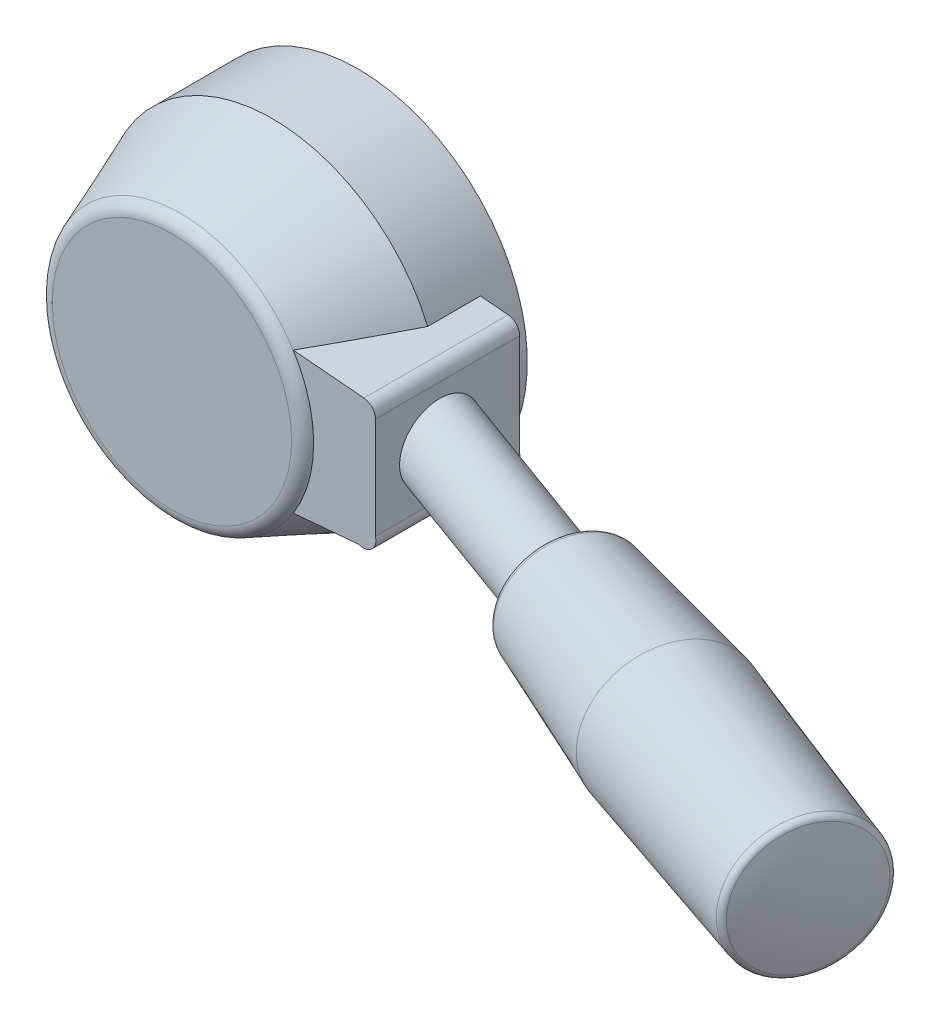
ISO-10303-21;
HEADER;
FILE_DESCRIPTION(('STEP AP214'),'2;1');
FILE_NAME('part.step','',(''),(''),'','','');
FILE_SCHEMA(('AUTOMOTIVE_DESIGN { 1 0 10303 214 1 1 1 1 }'));
ENDSEC;
DATA;
#1=APPLICATION_CONTEXT('core data for automotive mechanical design processes');
#2=APPLICATION_PROTOCOL_DEFINITION('international standard','automotive_design',2000,#1);
#3=PRODUCT_CONTEXT('',#1,'mechanical');
#4=PRODUCT('Part','Part','',(#3));
#5=PRODUCT_RELATED_PRODUCT_CATEGORY('part','',(#4));
#6=PRODUCT_DEFINITION_FORMATION('','',#4);
#7=PRODUCT_DEFINITION_CONTEXT('part definition',#1,'design');
#8=PRODUCT_DEFINITION('design','',#6,#7);
#9=PRODUCT_DEFINITION_SHAPE('','',#8);
#10=(LENGTH_UNIT() NAMED_UNIT(*) SI_UNIT(.MILLI.,.METRE.));
#11=(NAMED_UNIT(*) PLANE_ANGLE_UNIT() SI_UNIT($,.RADIAN.));
#12=(NAMED_UNIT(*) SI_UNIT($,.STERADIAN.) SOLID_ANGLE_UNIT());
#13=UNCERTAINTY_MEASURE_WITH_UNIT(LENGTH_MEASURE(1.E-05),#10,'distance_accuracy_value','');
#14=(GEOMETRIC_REPRESENTATION_CONTEXT(3) GLOBAL_UNCERTAINTY_ASSIGNED_CONTEXT((#13)) GLOBAL_UNIT_ASSIGNED_CONTEXT((#10,
#11,#12)) REPRESENTATION_CONTEXT('',''));
#15=CARTESIAN_POINT('',(0.,0.,0.));
#16=DIRECTION('',(0.,0.,1.));
#17=DIRECTION('',(1.,0.,0.));
#18=AXIS2_PLACEMENT_3D('',#15,#16,#17);
#19=CARTESIAN_POINT('',(-16.5,0.,0.300000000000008));
#20=DIRECTION('',(0.,0.,-1.));
#21=DIRECTION('',(0.,1.,0.));
#22=AXIS2_PLACEMENT_3D('',#19,#20,#21);
#23=PLANE('',#22);
#24=CARTESIAN_POINT('',(0.,0.,0.300000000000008));
#25=DIRECTION('',(0.,0.,1.));
#26=DIRECTION('',(0.,-1.,0.));
#27=AXIS2_PLACEMENT_3D('',#24,#25,#26);
#28=CIRCLE('',#27,13.);
#29=CARTESIAN_POINT('',(0.,-13.,0.300000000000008));
#30=VERTEX_POINT('',#29);
#31=EDGE_CURVE('E590',#30,#30,#28,.T.);
#32=ORIENTED_EDGE('',*,*,#31,.T.);
#33=EDGE_LOOP('',(#32));
#34=FACE_BOUND('',#33,.T.);
#35=CARTESIAN_POINT('',(0.,0.,0.300000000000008));
#36=DIRECTION('',(0.,0.,1.));
#37=DIRECTION('',(0.,-1.,0.));
#38=AXIS2_PLACEMENT_3D('',#35,#36,#37);
#39=CIRCLE('',#38,16.5);
#40=CARTESIAN_POINT('',(-3.06078551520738,16.2136236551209,0.300000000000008));
#41=VERTEX_POINT('',#40);
#42=CARTESIAN_POINT('',(-2.44985043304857,-16.3171147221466,0.300000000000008));
#43=VERTEX_POINT('',#42);
#44=EDGE_CURVE('E520',#41,#43,#39,.T.);
#45=ORIENTED_EDGE('',*,*,#44,.F.);
#46=CARTESIAN_POINT('',(-0.780493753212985,19.5,0.300000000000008));
#47=DIRECTION('',(0.,0.,-1.));
#48=DIRECTION('',(0.,1.,0.));
#49=AXIS2_PLACEMENT_3D('',#46,#47,#48);
#50=CIRCLE('',#49,4.);
#51=CARTESIAN_POINT('',(1.75515927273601,16.406383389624,0.300000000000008));
#52=VERTEX_POINT('',#51);
#53=EDGE_CURVE('E211',#52,#41,#50,.T.);
#54=ORIENTED_EDGE('',*,*,#53,.F.);
#55=CARTESIAN_POINT('',(2.40432256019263,-16.3238853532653,0.300000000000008));
#56=VERTEX_POINT('',#55);
#57=EDGE_CURVE('E223',#56,#52,#39,.T.);
#58=ORIENTED_EDGE('',*,*,#57,.F.);
#59=CARTESIAN_POINT('',(-0.0271987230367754,-19.5,0.300000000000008));
#60=DIRECTION('',(0.,0.,-1.));
#61=DIRECTION('',(0.,1.,0.));
#62=AXIS2_PLACEMENT_3D('',#59,#60,#61);
#63=CIRCLE('',#62,4.);
#64=EDGE_CURVE('E231',#43,#56,#63,.T.);
#65=ORIENTED_EDGE('',*,*,#64,.F.);
#66=EDGE_LOOP('',(#45,#54,#58,#65));
#67=FACE_BOUND('',#66,.T.);
#68=ADVANCED_FACE('F14',(#34,#67),#23,.T.);
#69=CARTESIAN_POINT('',(-27.,0.,0.300000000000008));
#70=DIRECTION('',(0.,0.,-1.));
#71=DIRECTION('',(0.,1.,0.));
#72=AXIS2_PLACEMENT_3D('',#69,#70,#71);
#73=PLANE('',#72);
#74=CARTESIAN_POINT('',(0.,0.,0.300000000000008));
#75=DIRECTION('',(0.,0.,1.));
#76=DIRECTION('',(0.,-1.,0.));
#77=AXIS2_PLACEMENT_3D('',#74,#75,#76);
#78=CIRCLE('',#77,27.);
#79=CARTESIAN_POINT('',(0.,-27.,0.300000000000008));
#80=VERTEX_POINT('',#79);
#81=EDGE_CURVE('E530',#80,#80,#78,.T.);
#82=ORIENTED_EDGE('',*,*,#81,.F.);
#83=EDGE_LOOP('',(#82));
#84=FACE_BOUND('',#83,.T.);
#85=CARTESIAN_POINT('',(0.,0.,0.300000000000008));
#86=DIRECTION('',(0.,0.,-1.));
#87=DIRECTION('',(0.,1.,0.));
#88=AXIS2_PLACEMENT_3D('',#85,#86,#87);
#89=CIRCLE('',#88,16.549827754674);
#90=CARTESIAN_POINT('',(1.80832752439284,16.4507370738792,0.300000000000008));
#91=VERTEX_POINT('',#90);
#92=CARTESIAN_POINT('',(7.02428559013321,14.9851997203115,0.300000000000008));
#93=VERTEX_POINT('',#92);
#94=EDGE_CURVE('E272',#91,#93,#89,.T.);
#95=ORIENTED_EDGE('',*,*,#94,.F.);
#96=CARTESIAN_POINT('',(-3.11732854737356,16.2535861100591,0.300000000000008));
#97=VERTEX_POINT('',#96);
#98=EDGE_CURVE('E217',#97,#91,#50,.T.);
#99=ORIENTED_EDGE('',*,*,#98,.F.);
#100=CARTESIAN_POINT('',(-8.24619228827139,14.3491153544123,0.300000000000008));
#101=VERTEX_POINT('',#100);
#102=EDGE_CURVE('E273',#101,#97,#89,.T.);
#103=ORIENTED_EDGE('',*,*,#102,.F.);
#104=CARTESIAN_POINT('',(-10.06485785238,17.5137568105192,0.300000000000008));
#105=DIRECTION('',(0.,0.,1.));
#106=DIRECTION('',(0.,-1.,0.));
#107=AXIS2_PLACEMENT_3D('',#104,#105,#106);
#108=CIRCLE('',#107,3.64999999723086);
#109=CARTESIAN_POINT('',(-11.2886327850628,20.9524883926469,0.300000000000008));
#110=VERTEX_POINT('',#109);
#111=EDGE_CURVE('E276',#101,#110,#108,.T.);
#112=ORIENTED_EDGE('',*,*,#111,.T.);
#113=CARTESIAN_POINT('',(0.,0.,0.300000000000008));
#114=DIRECTION('',(0.,0.,1.));
#115=DIRECTION('',(0.,-1.,0.));
#116=AXIS2_PLACEMENT_3D('',#113,#114,#115);
#117=CIRCLE('',#116,23.8);
#118=CARTESIAN_POINT('',(-9.50701874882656,-21.8187211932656,0.300000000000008));
#119=VERTEX_POINT('',#118);
#120=EDGE_CURVE('E528',#110,#119,#117,.T.);
#121=ORIENTED_EDGE('',*,*,#120,.T.);
#122=CARTESIAN_POINT('',(-8.57346439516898,-18.2901271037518,0.300000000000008));
#123=DIRECTION('',(0.,0.,1.));
#124=DIRECTION('',(0.,-1.,0.));
#125=AXIS2_PLACEMENT_3D('',#122,#123,#124);
#126=CIRCLE('',#125,3.64999999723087);
#127=CARTESIAN_POINT('',(-7.02428559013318,-14.9851997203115,0.300000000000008));
#128=VERTEX_POINT('',#127);
#129=EDGE_CURVE('E242',#119,#128,#126,.T.);
#130=ORIENTED_EDGE('',*,*,#129,.T.);
#131=CARTESIAN_POINT('',(0.,0.,0.300000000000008));
#132=DIRECTION('',(0.,0.,-1.));
#133=DIRECTION('',(0.,1.,0.));
#134=AXIS2_PLACEMENT_3D('',#131,#132,#133);
#135=CIRCLE('',#134,16.549827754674);
#136=CARTESIAN_POINT('',(-2.50424943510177,-16.359264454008,0.300000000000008));
#137=VERTEX_POINT('',#136);
#138=EDGE_CURVE('E245',#137,#128,#135,.T.);
#139=ORIENTED_EDGE('',*,*,#138,.F.);
#140=CARTESIAN_POINT('',(2.45860376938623,-16.3661866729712,0.300000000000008));
#141=VERTEX_POINT('',#140);
#142=EDGE_CURVE('E233',#141,#137,#63,.T.);
#143=ORIENTED_EDGE('',*,*,#142,.F.);
#144=CARTESIAN_POINT('',(8.24619228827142,-14.3491153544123,0.300000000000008));
#145=VERTEX_POINT('',#144);
#146=EDGE_CURVE('E246',#145,#141,#135,.T.);
#147=ORIENTED_EDGE('',*,*,#146,.F.);
#148=CARTESIAN_POINT('',(10.0648578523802,-17.5137568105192,0.300000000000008));
#149=DIRECTION('',(0.,0.,-1.));
#150=DIRECTION('',(0.,1.,0.));
#151=AXIS2_PLACEMENT_3D('',#148,#149,#150);
#152=CIRCLE('',#151,3.64999999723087);
#153=CARTESIAN_POINT('',(11.2886327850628,-20.9524883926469,0.300000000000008));
#154=VERTEX_POINT('',#153);
#155=EDGE_CURVE('E249',#154,#145,#152,.T.);
#156=ORIENTED_EDGE('',*,*,#155,.F.);
#157=CARTESIAN_POINT('',(9.50701874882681,21.8187211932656,0.300000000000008));
#158=VERTEX_POINT('',#157);
#159=EDGE_CURVE('E527',#154,#158,#117,.T.);
#160=ORIENTED_EDGE('',*,*,#159,.T.);
#161=CARTESIAN_POINT('',(8.57346439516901,18.2901271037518,0.300000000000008));
#162=DIRECTION('',(0.,0.,-1.));
#163=DIRECTION('',(0.,1.,0.));
#164=AXIS2_PLACEMENT_3D('',#161,#162,#163);
#165=CIRCLE('',#164,3.64999999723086);
#166=EDGE_CURVE('E269',#93,#158,#165,.T.);
#167=ORIENTED_EDGE('',*,*,#166,.F.);
#168=EDGE_LOOP('',(#95,#99,#103,#112,#121,#130,#139,#143,#147,#156,#160,#167));
#169=FACE_BOUND('',#168,.T.);
#170=ADVANCED_FACE('F493',(#84,#169),#73,.T.);
#171=CARTESIAN_POINT('',(0.,0.,33.3307595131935));
#172=DIRECTION('',(0.,0.,1.));
#173=DIRECTION('',(0.,-1.,0.));
#174=AXIS2_PLACEMENT_3D('',#171,#172,#173);
#175=CYLINDRICAL_SURFACE('',#174,16.5);
#176=CARTESIAN_POINT('',(0.,0.,25.));
#177=DIRECTION('',(0.,0.,1.));
#178=DIRECTION('',(0.,-1.,0.));
#179=AXIS2_PLACEMENT_3D('',#176,#177,#178);
#180=CIRCLE('',#179,16.5);
#181=CARTESIAN_POINT('',(15.235729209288,6.33423677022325,25.));
#182=VERTEX_POINT('',#181);
#183=CARTESIAN_POINT('',(15.235729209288,-6.33423677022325,25.));
#184=VERTEX_POINT('',#183);
#185=EDGE_CURVE('E510',#182,#184,#180,.T.);
#186=ORIENTED_EDGE('',*,*,#185,.F.);
#187=CARTESIAN_POINT('',(0.,0.,25.));
#188=DIRECTION('',(0.,0.,1.));
#189=DIRECTION('',(0.,-1.,0.));
#190=AXIS2_PLACEMENT_3D('',#187,#188,#189);
#191=CIRCLE('',#190,16.5);
#192=EDGE_CURVE('E298',#184,#182,#191,.T.);
#193=ORIENTED_EDGE('',*,*,#192,.F.);
#194=EDGE_LOOP('',(#186,#193));
#195=FACE_BOUND('',#194,.T.);
#196=CARTESIAN_POINT('',(0.,0.,16.3));
#197=DIRECTION('',(0.,0.,-1.));
#198=DIRECTION('',(0.,1.,0.));
#199=AXIS2_PLACEMENT_3D('',#196,#197,#198);
#200=CIRCLE('',#199,16.5);
#201=CARTESIAN_POINT('',(1.75515927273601,16.406383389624,16.3));
#202=VERTEX_POINT('',#201);
#203=CARTESIAN_POINT('',(-3.06078551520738,16.2136236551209,16.3));
#204=VERTEX_POINT('',#203);
#205=EDGE_CURVE('E205',#202,#204,#200,.F.);
#206=ORIENTED_EDGE('',*,*,#205,.T.);
#207=DIRECTION('',(0.,0.,-1.));
#208=VECTOR('',#207,1.);
#209=CARTESIAN_POINT('',(-3.06078551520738,16.2136236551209,8.3));
#210=LINE('',#209,#208);
#211=EDGE_CURVE('E216',#204,#41,#210,.T.);
#212=ORIENTED_EDGE('',*,*,#211,.T.);
#213=ORIENTED_EDGE('',*,*,#44,.T.);
#214=DIRECTION('',(0.,0.,-1.));
#215=VECTOR('',#214,1.);
#216=CARTESIAN_POINT('',(-2.44985043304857,-16.3171147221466,8.3));
#217=LINE('',#216,#215);
#218=CARTESIAN_POINT('',(-2.44985043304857,-16.3171147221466,16.3));
#219=VERTEX_POINT('',#218);
#220=EDGE_CURVE('E237',#43,#219,#217,.F.);
#221=ORIENTED_EDGE('',*,*,#220,.T.);
#222=CARTESIAN_POINT('',(0.,0.,16.3));
#223=DIRECTION('',(0.,0.,-1.));
#224=DIRECTION('',(0.,1.,0.));
#225=AXIS2_PLACEMENT_3D('',#222,#223,#224);
#226=CIRCLE('',#225,16.5);
#227=CARTESIAN_POINT('',(2.40432256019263,-16.3238853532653,16.3));
#228=VERTEX_POINT('',#227);
#229=EDGE_CURVE('E234',#219,#228,#226,.F.);
#230=ORIENTED_EDGE('',*,*,#229,.T.);
#231=DIRECTION('',(0.,0.,-1.));
#232=VECTOR('',#231,1.);
#233=CARTESIAN_POINT('',(2.40432256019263,-16.3238853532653,8.3));
#234=LINE('',#233,#232);
#235=EDGE_CURVE('E240',#228,#56,#234,.T.);
#236=ORIENTED_EDGE('',*,*,#235,.T.);
#237=ORIENTED_EDGE('',*,*,#57,.T.);
#238=DIRECTION('',(0.,0.,-1.));
#239=VECTOR('',#238,1.);
#240=CARTESIAN_POINT('',(1.75515927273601,16.406383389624,8.3));
#241=LINE('',#240,#239);
#242=EDGE_CURVE('E210',#52,#202,#241,.F.);
#243=ORIENTED_EDGE('',*,*,#242,.T.);
#244=EDGE_LOOP('',(#206,#212,#213,#221,#230,#236,#237,#243));
#245=FACE_BOUND('',#244,.T.);
#246=ADVANCED_FACE('F220',(#195,#245),#175,.T.);
#247=CARTESIAN_POINT('',(0.,0.,21.8));
#248=DIRECTION('',(0.,0.,-1.));
#249=DIRECTION('',(0.,1.,0.));
#250=AXIS2_PLACEMENT_3D('',#247,#248,#249);
#251=CYLINDRICAL_SURFACE('',#250,16.549827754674);
#252=DIRECTION('',(0.,0.,-1.));
#253=VECTOR('',#252,1.);
#254=CARTESIAN_POINT('',(1.80832752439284,16.4507370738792,8.3));
#255=LINE('',#254,#253);
#256=CARTESIAN_POINT('',(1.80832752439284,16.4507370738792,16.3));
#257=VERTEX_POINT('',#256);
#258=EDGE_CURVE('E9',#91,#257,#255,.F.);
#259=ORIENTED_EDGE('',*,*,#258,.F.);
#260=ORIENTED_EDGE('',*,*,#94,.T.);
#261=DIRECTION('',(0.,0.,-1.));
#262=VECTOR('',#261,1.);
#263=CARTESIAN_POINT('',(7.02428559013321,14.9851997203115,21.8));
#264=LINE('',#263,#262);
#265=CARTESIAN_POINT('',(7.02428559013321,14.9851997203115,21.8));
#266=VERTEX_POINT('',#265);
#267=EDGE_CURVE('E287',#266,#93,#264,.T.);
#268=ORIENTED_EDGE('',*,*,#267,.F.);
#269=CARTESIAN_POINT('',(0.,0.,21.8));
#270=DIRECTION('',(0.,0.,-1.));
#271=DIRECTION('',(0.,1.,0.));
#272=AXIS2_PLACEMENT_3D('',#269,#270,#271);
#273=CIRCLE('',#272,16.549827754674);
#274=CARTESIAN_POINT('',(-8.24619228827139,14.3491153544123,21.8));
#275=VERTEX_POINT('',#274);
#276=EDGE_CURVE('E281',#275,#266,#273,.T.);
#277=ORIENTED_EDGE('',*,*,#276,.F.);
#278=DIRECTION('',(0.,0.,-1.));
#279=VECTOR('',#278,1.);
#280=CARTESIAN_POINT('',(-8.24619228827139,14.3491153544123,21.8));
#281=LINE('',#280,#279);
#282=EDGE_CURVE('E290',#275,#101,#281,.T.);
#283=ORIENTED_EDGE('',*,*,#282,.T.);
#284=ORIENTED_EDGE('',*,*,#102,.T.);
#285=DIRECTION('',(0.,0.,-1.));
#286=VECTOR('',#285,1.);
#287=CARTESIAN_POINT('',(-3.11732854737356,16.2535861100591,8.3));
#288=LINE('',#287,#286);
#289=CARTESIAN_POINT('',(-3.11732854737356,16.2535861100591,16.3));
#290=VERTEX_POINT('',#289);
#291=EDGE_CURVE('E22',#290,#97,#288,.T.);
#292=ORIENTED_EDGE('',*,*,#291,.F.);
#293=CARTESIAN_POINT('',(0.,0.,16.3));
#294=DIRECTION('',(0.,0.,-1.));
#295=DIRECTION('',(0.,1.,0.));
#296=AXIS2_PLACEMENT_3D('',#293,#294,#295);
#297=CIRCLE('',#296,16.549827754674);
#298=EDGE_CURVE('E610',#257,#290,#297,.F.);
#299=ORIENTED_EDGE('',*,*,#298,.F.);
#300=EDGE_LOOP('',(#259,#260,#268,#277,#283,#284,#292,#299));
#301=FACE_BOUND('',#300,.T.);
#302=ADVANCED_FACE('F496',(#301),#251,.F.);
#303=CARTESIAN_POINT('',(0.,0.,21.8));
#304=DIRECTION('',(0.,0.,-1.));
#305=DIRECTION('',(0.,1.,0.));
#306=AXIS2_PLACEMENT_3D('',#303,#304,#305);
#307=CYLINDRICAL_SURFACE('',#306,16.549827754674);
#308=DIRECTION('',(0.,0.,-1.));
#309=VECTOR('',#308,1.);
#310=CARTESIAN_POINT('',(-2.50424943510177,-16.359264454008,8.3));
#311=LINE('',#310,#309);
#312=CARTESIAN_POINT('',(-2.50424943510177,-16.359264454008,16.3));
#313=VERTEX_POINT('',#312);
#314=EDGE_CURVE('E1052',#137,#313,#311,.F.);
#315=ORIENTED_EDGE('',*,*,#314,.F.);
#316=ORIENTED_EDGE('',*,*,#138,.T.);
#317=DIRECTION('',(0.,0.,-1.));
#318=VECTOR('',#317,1.);
#319=CARTESIAN_POINT('',(-7.02428559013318,-14.9851997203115,21.8));
#320=LINE('',#319,#318);
#321=CARTESIAN_POINT('',(-7.02428559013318,-14.9851997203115,21.8));
#322=VERTEX_POINT('',#321);
#323=EDGE_CURVE('E258',#322,#128,#320,.T.);
#324=ORIENTED_EDGE('',*,*,#323,.F.);
#325=CARTESIAN_POINT('',(0.,0.,21.8));
#326=DIRECTION('',(0.,0.,-1.));
#327=DIRECTION('',(0.,1.,0.));
#328=AXIS2_PLACEMENT_3D('',#325,#326,#327);
#329=CIRCLE('',#328,16.549827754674);
#330=CARTESIAN_POINT('',(8.24619228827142,-14.3491153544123,21.8));
#331=VERTEX_POINT('',#330);
#332=EDGE_CURVE('E253',#331,#322,#329,.T.);
#333=ORIENTED_EDGE('',*,*,#332,.F.);
#334=DIRECTION('',(0.,0.,-1.));
#335=VECTOR('',#334,1.);
#336=CARTESIAN_POINT('',(8.24619228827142,-14.3491153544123,21.8));
#337=LINE('',#336,#335);
#338=EDGE_CURVE('E261',#331,#145,#337,.T.);
#339=ORIENTED_EDGE('',*,*,#338,.T.);
#340=ORIENTED_EDGE('',*,*,#146,.T.);
#341=DIRECTION('',(0.,0.,-1.));
#342=VECTOR('',#341,1.);
#343=CARTESIAN_POINT('',(2.45860376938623,-16.3661866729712,8.3));
#344=LINE('',#343,#342);
#345=CARTESIAN_POINT('',(2.45860376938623,-16.3661866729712,16.3));
#346=VERTEX_POINT('',#345);
#347=EDGE_CURVE('E1057',#346,#141,#344,.T.);
#348=ORIENTED_EDGE('',*,*,#347,.F.);
#349=CARTESIAN_POINT('',(0.,0.,16.3));
#350=DIRECTION('',(0.,0.,-1.));
#351=DIRECTION('',(0.,1.,0.));
#352=AXIS2_PLACEMENT_3D('',#349,#350,#351);
#353=CIRCLE('',#352,16.549827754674);
#354=EDGE_CURVE('E638',#313,#346,#353,.F.);
#355=ORIENTED_EDGE('',*,*,#354,.F.);
#356=EDGE_LOOP('',(#315,#316,#324,#333,#339,#340,#348,#355));
#357=FACE_BOUND('',#356,.T.);
#358=ADVANCED_FACE('F504',(#357),#307,.F.);
#359=CARTESIAN_POINT('',(0.,0.,33.3307595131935));
#360=DIRECTION('',(0.,0.,1.));
#361=DIRECTION('',(0.,-1.,0.));
#362=AXIS2_PLACEMENT_3D('',#359,#360,#361);
#363=CYLINDRICAL_SURFACE('',#362,23.8);
#364=DIRECTION('',(0.,0.,-1.));
#365=VECTOR('',#364,1.);
#366=CARTESIAN_POINT('',(11.288632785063,-20.9524883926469,7.40737388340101));
#367=LINE('',#366,#365);
#368=CARTESIAN_POINT('',(11.288632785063,-20.9524883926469,14.514747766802));
#369=VERTEX_POINT('',#368);
#370=EDGE_CURVE('E264',#369,#154,#367,.T.);
#371=ORIENTED_EDGE('',*,*,#370,.F.);
#372=CARTESIAN_POINT('',(0.,0.,14.514747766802));
#373=DIRECTION('',(0.,0.,1.));
#374=DIRECTION('',(0.,-1.,0.));
#375=AXIS2_PLACEMENT_3D('',#372,#373,#374);
#376=CIRCLE('',#375,23.8);
#377=CARTESIAN_POINT('',(9.50701874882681,21.8187211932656,14.514747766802));
#378=VERTEX_POINT('',#377);
#379=EDGE_CURVE('E518',#369,#378,#376,.T.);
#380=ORIENTED_EDGE('',*,*,#379,.T.);
#381=DIRECTION('',(0.,0.,-1.));
#382=VECTOR('',#381,1.);
#383=CARTESIAN_POINT('',(9.50701874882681,21.8187211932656,7.40737388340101));
#384=LINE('',#383,#382);
#385=EDGE_CURVE('E292',#158,#378,#384,.F.);
#386=ORIENTED_EDGE('',*,*,#385,.F.);
#387=ORIENTED_EDGE('',*,*,#159,.F.);
#388=EDGE_LOOP('',(#371,#380,#386,#387));
#389=FACE_BOUND('',#388,.T.);
#390=ADVANCED_FACE('F620',(#389),#363,.F.);
#391=CARTESIAN_POINT('',(15.235729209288,11.5012440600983,5.57999999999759));
#392=DIRECTION('',(-1.,0.,0.));
#393=DIRECTION('',(0.,0.,-1.));
#394=AXIS2_PLACEMENT_3D('',#391,#392,#393);
#395=PLANE('',#394);
#396=CARTESIAN_POINT('',(15.235729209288,-6.36763904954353,24.8040664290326));
#397=CARTESIAN_POINT('',(15.2357292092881,-6.36183368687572,24.8210523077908));
#398=CARTESIAN_POINT('',(15.2357292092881,-6.35671509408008,24.8382709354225));
#399=CARTESIAN_POINT('',(15.2357292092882,-6.34796784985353,24.873092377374));
#400=CARTESIAN_POINT('',(15.2357292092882,-6.34434010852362,24.8906954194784));
#401=CARTESIAN_POINT('',(15.2357292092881,-6.33592101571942,24.9436534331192));
#402=CARTESIAN_POINT('',(15.235729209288,-6.33350058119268,24.9794226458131));
#403=CARTESIAN_POINT('',(15.235729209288,-6.33540802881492,25.0522707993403));
#404=CARTESIAN_POINT('',(15.2357292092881,-6.34002415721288,25.089341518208));
#405=CARTESIAN_POINT('',(15.2357292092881,-6.35590115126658,25.1620116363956));
#406=CARTESIAN_POINT('',(15.235729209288,-6.36716745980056,25.1976098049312));
#407=CARTESIAN_POINT('',(15.235729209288,-6.3991675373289,25.2765559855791));
#408=CARTESIAN_POINT('',(15.2357292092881,-6.42169837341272,25.3191620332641));
#409=CARTESIAN_POINT('',(15.2357292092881,-6.47314697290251,25.4003585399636));
#410=CARTESIAN_POINT('',(15.235729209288,-6.50208523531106,25.4389355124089));
#411=CARTESIAN_POINT('',(15.235729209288,-6.56087566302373,25.5082320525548));
#412=CARTESIAN_POINT('',(15.2357292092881,-6.59026977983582,25.539348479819));
#413=CARTESIAN_POINT('',(15.2357292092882,-6.6516178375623,25.5989667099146));
#414=CARTESIAN_POINT('',(15.2357292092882,-6.68357390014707,25.6274663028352));
#415=CARTESIAN_POINT('',(15.2357292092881,-6.78235334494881,25.7096050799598));
#416=CARTESIAN_POINT('',(15.235729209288,-6.85202200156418,25.759811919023));
#417=CARTESIAN_POINT('',(15.235729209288,-7.00309533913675,25.8578211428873));
#418=CARTESIAN_POINT('',(15.2357292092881,-7.0849745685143,25.9048679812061));
#419=CARTESIAN_POINT('',(15.2357292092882,-7.25235058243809,25.9921630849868));
#420=CARTESIAN_POINT('',(15.2357292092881,-7.33785126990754,26.0324037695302));
#421=CARTESIAN_POINT('',(15.2357292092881,-7.51152941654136,26.1071855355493));
#422=CARTESIAN_POINT('',(15.2357292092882,-7.59971286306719,26.1417125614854));
#423=CARTESIAN_POINT('',(15.2357292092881,-7.77793622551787,26.205614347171));
#424=CARTESIAN_POINT('',(15.235729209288,-7.86797665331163,26.2349876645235));
#425=CARTESIAN_POINT('',(15.235729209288,-8.11415380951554,26.3082292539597));
#426=CARTESIAN_POINT('',(15.2357292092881,-8.27166982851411,26.347511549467));
#427=CARTESIAN_POINT('',(15.2357292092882,-8.58948920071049,26.4129800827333));
#428=CARTESIAN_POINT('',(15.2357292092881,-8.7497946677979,26.4391558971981));
#429=CARTESIAN_POINT('',(15.2357292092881,-9.0719218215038,26.4781478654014));
#430=CARTESIAN_POINT('',(15.2357292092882,-9.23374222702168,26.4909744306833));
#431=CARTESIAN_POINT('',(15.2357292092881,-9.55775667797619,26.5023423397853));
#432=CARTESIAN_POINT('',(15.235729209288,-9.71995028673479,26.500895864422));
#433=CARTESIAN_POINT('',(15.235729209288,-10.0552860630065,26.4813590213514));
#434=CARTESIAN_POINT('',(15.2357292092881,-10.2283706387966,26.4620711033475));
#435=CARTESIAN_POINT('',(15.2357292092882,-10.4847050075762,26.4169882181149));
#436=CARTESIAN_POINT('',(15.2357292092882,-10.5694182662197,26.3993252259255));
#437=CARTESIAN_POINT('',(15.2357292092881,-10.7373751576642,26.3580746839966));
#438=CARTESIAN_POINT('',(15.235729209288,-10.8206195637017,26.3344903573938));
#439=CARTESIAN_POINT('',(15.235729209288,-10.9628733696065,26.287960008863));
#440=CARTESIAN_POINT('',(15.2357292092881,-11.0223845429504,26.2665452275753));
#441=CARTESIAN_POINT('',(15.2357292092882,-11.139859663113,26.219896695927));
#442=CARTESIAN_POINT('',(15.2357292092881,-11.1978245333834,26.1946652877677));
#443=CARTESIAN_POINT('',(15.2357292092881,-11.3122694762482,26.1397973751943));
#444=CARTESIAN_POINT('',(15.2357292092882,-11.3687324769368,26.1101248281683));
#445=CARTESIAN_POINT('',(15.2357292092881,-11.4790618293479,26.0460886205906));
#446=CARTESIAN_POINT('',(15.2357292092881,-11.5329231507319,26.0117163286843));
#447=CARTESIAN_POINT('',(15.235729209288,-11.5850829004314,25.974823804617));
#448=B_SPLINE_CURVE_WITH_KNOTS('',3,(#396,#397,#398,#399,#400,#401,#402,#403,#404,#405,#406,
#407,#408,#409,#410,#411,#412,#413,#414,#415,#416,#417,#418,#419,#420,#421,#422,#423,#424,#425,
#426,#427,#428,#429,#430,#431,#432,#433,#434,#435,#436,#437,#438,#439,#440,#441,#442,#443,#444,
#445,#446,#447),.UNSPECIFIED.,.F.,.F.,(4,2,2,2,2,2,2,2,2,2,2,2,2,2,2,2,2,2,2,2,2,2,2,2,2,4),(0.,
0.0538289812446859,0.107690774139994,0.214582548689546,0.325972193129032,0.43745313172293,
0.581225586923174,0.725464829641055,0.853692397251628,0.982027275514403,1.23898785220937,
1.52191243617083,1.80515010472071,2.08907449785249,2.37307822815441,2.85945624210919,
3.34622044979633,3.8326047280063,4.31857395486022,4.83973074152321,5.09917006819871,
5.35846848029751,5.54809401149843,5.73760364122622,5.92874424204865,6.12024072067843),.UNSPECIFIED.);
#449=CARTESIAN_POINT('',(15.235729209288,-11.5012440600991,26.0310956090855));
#450=VERTEX_POINT('',#449);
#451=EDGE_CURVE('E564',#184,#450,#448,.T.);
#452=ORIENTED_EDGE('',*,*,#451,.F.);
#453=CARTESIAN_POINT('',(15.235729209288,-6.33403099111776,24.9599188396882));
#454=CARTESIAN_POINT('',(15.2357292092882,-6.33286178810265,24.9956494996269));
#455=CARTESIAN_POINT('',(15.2357292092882,-6.33523026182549,25.0313562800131));
#456=CARTESIAN_POINT('',(15.2357292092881,-6.34616088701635,25.1013725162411));
#457=CARTESIAN_POINT('',(15.235729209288,-6.35464554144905,25.1356938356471));
#458=CARTESIAN_POINT('',(15.235729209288,-6.37978557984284,25.2110582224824));
#459=CARTESIAN_POINT('',(15.2357292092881,-6.39797428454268,25.2515793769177));
#460=CARTESIAN_POINT('',(15.2357292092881,-6.44060960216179,25.329329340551));
#461=CARTESIAN_POINT('',(15.235729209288,-6.46508881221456,25.3665395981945));
#462=CARTESIAN_POINT('',(15.235729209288,-6.52760030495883,25.4497553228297));
#463=CARTESIAN_POINT('',(15.2357292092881,-6.56740343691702,25.4944106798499));
#464=CARTESIAN_POINT('',(15.2357292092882,-6.65203347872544,25.5784929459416));
#465=CARTESIAN_POINT('',(15.235729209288,-6.696860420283,25.6179198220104));
#466=CARTESIAN_POINT('',(15.235729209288,-6.80692979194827,25.7061489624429));
#467=CARTESIAN_POINT('',(15.2357292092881,-6.87364037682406,25.7531026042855));
#468=CARTESIAN_POINT('',(15.2357292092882,-7.01108419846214,25.8407784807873));
#469=CARTESIAN_POINT('',(15.2357292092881,-7.08182362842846,25.8814907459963));
#470=CARTESIAN_POINT('',(15.2357292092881,-7.22638487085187,25.9579300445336));
#471=CARTESIAN_POINT('',(15.2357292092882,-7.30022052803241,25.9936306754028));
#472=CARTESIAN_POINT('',(15.2357292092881,-7.44990730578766,26.060549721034));
#473=CARTESIAN_POINT('',(15.235729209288,-7.52575923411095,26.0917663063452));
#474=CARTESIAN_POINT('',(15.2357292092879,-7.74597247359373,26.1757765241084));
#475=CARTESIAN_POINT('',(15.2357292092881,-7.8922525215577,26.2235741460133));
#476=CARTESIAN_POINT('',(15.2357292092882,-8.18833176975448,26.3069386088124));
#477=CARTESIAN_POINT('',(15.2357292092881,-8.33813416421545,26.3424938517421));
#478=CARTESIAN_POINT('',(15.2357292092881,-8.63980596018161,26.4017781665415));
#479=CARTESIAN_POINT('',(15.2357292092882,-8.79167158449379,26.4255264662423));
#480=CARTESIAN_POINT('',(15.2357292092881,-9.09672237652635,26.4610523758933));
#481=CARTESIAN_POINT('',(15.235729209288,-9.24990666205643,26.4728374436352));
#482=CARTESIAN_POINT('',(15.235729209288,-9.51470847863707,26.4821461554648));
#483=CARTESIAN_POINT('',(15.2357292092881,-9.62622426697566,26.4826909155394));
#484=CARTESIAN_POINT('',(15.2357292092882,-9.84904698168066,26.4765174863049));
#485=CARTESIAN_POINT('',(15.2357292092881,-9.96035395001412,26.4698009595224));
#486=CARTESIAN_POINT('',(15.2357292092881,-10.1821497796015,26.4484153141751));
#487=CARTESIAN_POINT('',(15.2357292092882,-10.2926391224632,26.4337513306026));
#488=CARTESIAN_POINT('',(15.2357292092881,-10.5120391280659,26.3955622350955));
#489=CARTESIAN_POINT('',(15.235729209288,-10.6209506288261,26.3720420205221));
#490=CARTESIAN_POINT('',(15.235729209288,-10.8523131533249,26.3106669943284));
#491=CARTESIAN_POINT('',(15.2357292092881,-10.9743467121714,26.2711920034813));
#492=CARTESIAN_POINT('',(15.2357292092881,-11.2118212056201,26.1767991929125));
#493=CARTESIAN_POINT('',(15.235729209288,-11.3272909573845,26.121956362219));
#494=CARTESIAN_POINT('',(15.235729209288,-11.5181172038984,26.0110039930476));
#495=CARTESIAN_POINT('',(15.2357292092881,-11.5959218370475,25.9591852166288));
#496=CARTESIAN_POINT('',(15.2357292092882,-11.7064817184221,25.8729155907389));
#497=CARTESIAN_POINT('',(15.2357292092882,-11.7424555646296,25.8425822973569));
#498=CARTESIAN_POINT('',(15.2357292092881,-11.8117540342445,25.7789158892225));
#499=CARTESIAN_POINT('',(15.2357292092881,-11.8450737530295,25.7455774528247));
#500=CARTESIAN_POINT('',(15.235729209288,-11.8767741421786,25.7106966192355));
#501=B_SPLINE_CURVE_WITH_KNOTS('',3,(#453,#454,#455,#456,#457,#458,#459,#460,#461,#462,#463,
#464,#465,#466,#467,#468,#469,#470,#471,#472,#473,#474,#475,#476,#477,#478,#479,#480,#481,#482,
#483,#484,#485,#486,#487,#488,#489,#490,#491,#492,#493,#494,#495,#496,#497,#498,#499,#500),
.UNSPECIFIED.,.F.,.F.,(4,2,2,2,2,2,2,2,2,2,2,2,2,2,2,2,2,2,2,2,2,2,2,4),(0.,0.106875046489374,
0.212419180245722,0.344918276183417,0.478118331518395,0.656919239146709,0.835721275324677,
1.07995153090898,1.32456792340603,1.57042818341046,1.81638846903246,2.27738326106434,
2.73881358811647,3.19948998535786,3.659879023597,3.99422399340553,4.32849242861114,
4.66254514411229,4.9964134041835,5.38032496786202,5.76239487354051,6.04191747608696,
6.18293000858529,6.32419735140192),.UNSPECIFIED.);
#502=CARTESIAN_POINT('',(15.235729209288,-11.5012440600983,26.0193885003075));
#503=VERTEX_POINT('',#502);
#504=EDGE_CURVE('E344',#184,#503,#501,.T.);
#505=ORIENTED_EDGE('',*,*,#504,.T.);
#506=DIRECTION('',(0.,0.,1.));
#507=VECTOR('',#506,1.);
#508=CARTESIAN_POINT('',(15.235729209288,-11.5012440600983,5.57999999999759));
#509=LINE('',#508,#507);
#510=EDGE_CURVE('E400',#503,#450,#509,.T.);
#511=ORIENTED_EDGE('',*,*,#510,.T.);
#512=EDGE_LOOP('',(#452,#505,#511));
#513=FACE_BOUND('',#512,.T.);
#514=ADVANCED_FACE('F319',(#513),#395,.T.);
#515=DIRECTION('',(0.,0.,1.));
#516=VECTOR('',#515,1.);
#517=CARTESIAN_POINT('',(15.235729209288,11.5012440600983,5.57999999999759));
#518=LINE('',#517,#516);
#519=CARTESIAN_POINT('',(15.235729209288,11.5012440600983,26.0193885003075));
#520=VERTEX_POINT('',#519);
#521=CARTESIAN_POINT('',(15.235729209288,11.5012440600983,26.031095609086));
#522=VERTEX_POINT('',#521);
#523=EDGE_CURVE('E398',#520,#522,#518,.T.);
#524=ORIENTED_EDGE('',*,*,#523,.F.);
#525=CARTESIAN_POINT('',(15.235729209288,11.7333945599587,25.849530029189));
#526=CARTESIAN_POINT('',(15.2357292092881,11.6845640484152,25.8913477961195));
#527=CARTESIAN_POINT('',(15.2357292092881,11.6335232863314,25.9304422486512));
#528=CARTESIAN_POINT('',(15.2357292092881,11.5280656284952,26.0034905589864));
#529=CARTESIAN_POINT('',(15.2357292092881,11.4736577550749,26.0374573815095));
#530=CARTESIAN_POINT('',(15.2357292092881,11.3629187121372,26.1003872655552));
#531=CARTESIAN_POINT('',(15.2357292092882,11.3066184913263,26.1294055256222));
#532=CARTESIAN_POINT('',(15.2357292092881,11.1920355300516,26.1833242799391));
#533=CARTESIAN_POINT('',(15.235729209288,11.1337511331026,26.2082212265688));
#534=CARTESIAN_POINT('',(15.235729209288,10.9822957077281,26.267233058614));
#535=CARTESIAN_POINT('',(15.2357292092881,10.8880475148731,26.2985912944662));
#536=CARTESIAN_POINT('',(15.2357292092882,10.697233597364,26.3531033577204));
#537=CARTESIAN_POINT('',(15.2357292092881,10.6006672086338,26.3762548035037));
#538=CARTESIAN_POINT('',(15.2357292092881,10.4052754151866,26.4154116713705));
#539=CARTESIAN_POINT('',(15.2357292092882,10.3064378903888,26.4313559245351));
#540=CARTESIAN_POINT('',(15.2357292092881,10.1079032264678,26.4565477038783));
#541=CARTESIAN_POINT('',(15.235729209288,10.0082058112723,26.4657929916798));
#542=CARTESIAN_POINT('',(15.235729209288,9.75260149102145,26.4816250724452));
#543=CARTESIAN_POINT('',(15.2357292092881,9.59641517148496,26.483839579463));
#544=CARTESIAN_POINT('',(15.2357292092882,9.28437382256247,26.4749783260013));
#545=CARTESIAN_POINT('',(15.2357292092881,9.12851908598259,26.4638936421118));
#546=CARTESIAN_POINT('',(15.2357292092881,8.81887088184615,26.4294046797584));
#547=CARTESIAN_POINT('',(15.2357292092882,8.66507139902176,26.4060541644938));
#548=CARTESIAN_POINT('',(15.2357292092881,8.3598846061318,26.3473593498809));
#549=CARTESIAN_POINT('',(15.235729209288,8.20849572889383,26.3120232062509));
#550=CARTESIAN_POINT('',(15.235729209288,7.9240701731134,26.2330019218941));
#551=CARTESIAN_POINT('',(15.2357292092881,7.7907091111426,26.1905010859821));
#552=CARTESIAN_POINT('',(15.2357292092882,7.59353957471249,26.1181635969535));
#553=CARTESIAN_POINT('',(15.2357292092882,7.52816601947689,26.0925596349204));
#554=CARTESIAN_POINT('',(15.2357292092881,7.39874083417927,26.0382172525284));
#555=CARTESIAN_POINT('',(15.235729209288,7.3346889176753,26.0094795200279));
#556=CARTESIAN_POINT('',(15.235729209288,7.20739002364,25.9480594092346));
#557=CARTESIAN_POINT('',(15.2357292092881,7.14416673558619,25.9153276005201));
#558=CARTESIAN_POINT('',(15.2357292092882,7.02008790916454,25.8456836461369));
#559=CARTESIAN_POINT('',(15.2357292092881,6.95923095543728,25.8087740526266));
#560=CARTESIAN_POINT('',(15.2357292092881,6.84112166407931,25.7301233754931));
#561=CARTESIAN_POINT('',(15.2357292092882,6.78385288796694,25.6884072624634));
#562=CARTESIAN_POINT('',(15.2357292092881,6.67435389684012,25.5988995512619));
#563=CARTESIAN_POINT('',(15.235729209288,6.62211106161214,25.5511239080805));
#564=CARTESIAN_POINT('',(15.235729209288,6.53865352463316,25.4618370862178));
#565=CARTESIAN_POINT('',(15.2357292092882,6.5055641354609,25.4221020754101));
#566=CARTESIAN_POINT('',(15.2357292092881,6.44584815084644,25.3380673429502));
#567=CARTESIAN_POINT('',(15.235729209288,6.41919944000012,25.2937840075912));
#568=CARTESIAN_POINT('',(15.235729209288,6.38218763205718,25.2152986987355));
#569=CARTESIAN_POINT('',(15.2357292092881,6.36933796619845,25.182283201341));
#570=CARTESIAN_POINT('',(15.2357292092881,6.34919267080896,25.114605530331));
#571=CARTESIAN_POINT('',(15.235729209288,6.34188905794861,25.07994580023));
#572=CARTESIAN_POINT('',(15.235729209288,6.3336431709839,25.0097637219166));
#573=CARTESIAN_POINT('',(15.2357292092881,6.33271406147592,24.9742397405));
#574=CARTESIAN_POINT('',(15.2357292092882,6.33619926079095,24.9211708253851));
#575=CARTESIAN_POINT('',(15.2357292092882,6.33819523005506,24.9034344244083));
#576=CARTESIAN_POINT('',(15.2357292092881,6.34375998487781,24.8682109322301));
#577=CARTESIAN_POINT('',(15.2357292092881,6.34732861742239,24.850723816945));
#578=CARTESIAN_POINT('',(15.235729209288,6.35164332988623,24.8334187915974));
#579=B_SPLINE_CURVE_WITH_KNOTS('',3,(#525,#526,#527,#528,#529,#530,#531,#532,#533,#534,#535,
#536,#537,#538,#539,#540,#541,#542,#543,#544,#545,#546,#547,#548,#549,#550,#551,#552,#553,#554,
#555,#556,#557,#558,#559,#560,#561,#562,#563,#564,#565,#566,#567,#568,#569,#570,#571,#572,#573,
#574,#575,#576,#577,#578),.UNSPECIFIED.,.F.,.F.,(4,2,2,2,2,2,2,2,2,2,2,2,2,2,2,2,2,2,2,2,2,2,2,
2,2,2,4),(0.,0.19263922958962,0.38478292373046,0.574618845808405,0.764617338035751,
1.06213610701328,1.35974114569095,1.65982666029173,1.96001239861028,2.42793751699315,
2.89617677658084,3.36238058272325,3.82826779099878,4.24768591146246,4.45824686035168,
4.66876168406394,4.88221285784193,5.09553433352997,5.30779369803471,5.51950534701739,
5.6742206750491,5.82839695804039,5.93428506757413,6.04002046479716,6.14597416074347,
6.19945676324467,6.25293416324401),.UNSPECIFIED.);
#580=EDGE_CURVE('E303',#520,#182,#579,.T.);
#581=ORIENTED_EDGE('',*,*,#580,.T.);
#582=CARTESIAN_POINT('',(15.235729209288,11.7076237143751,25.880374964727));
#583=CARTESIAN_POINT('',(15.2357292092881,11.65857263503,25.9215674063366));
#584=CARTESIAN_POINT('',(15.2357292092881,11.6073749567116,25.9600648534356));
#585=CARTESIAN_POINT('',(15.2357292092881,11.5017002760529,26.0319798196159));
#586=CARTESIAN_POINT('',(15.2357292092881,11.4472317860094,26.0654097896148));
#587=CARTESIAN_POINT('',(15.2357292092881,11.3364281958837,26.1273368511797));
#588=CARTESIAN_POINT('',(15.2357292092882,11.2801224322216,26.1558871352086));
#589=CARTESIAN_POINT('',(15.2357292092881,11.1655826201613,26.2089166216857));
#590=CARTESIAN_POINT('',(15.235729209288,11.1073469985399,26.2333923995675));
#591=CARTESIAN_POINT('',(15.235729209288,10.9552489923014,26.2916935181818));
#592=CARTESIAN_POINT('',(15.2357292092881,10.8603071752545,26.3227117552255));
#593=CARTESIAN_POINT('',(15.2357292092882,10.6681396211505,26.3764984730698));
#594=CARTESIAN_POINT('',(15.2357292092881,10.5709132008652,26.399264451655));
#595=CARTESIAN_POINT('',(15.2357292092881,10.3742395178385,26.4376053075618));
#596=CARTESIAN_POINT('',(15.2357292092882,10.2747805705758,26.4531195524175));
#597=CARTESIAN_POINT('',(15.2357292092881,10.075033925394,26.4774156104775));
#598=CARTESIAN_POINT('',(15.235729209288,9.97474596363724,26.4861951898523));
#599=CARTESIAN_POINT('',(15.235729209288,9.71816832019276,26.5007619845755));
#600=CARTESIAN_POINT('',(15.2357292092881,9.56162321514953,26.5021992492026));
#601=CARTESIAN_POINT('',(15.2357292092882,9.2489270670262,26.4917696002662));
#602=CARTESIAN_POINT('',(15.2357292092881,9.09277636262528,26.4798936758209));
#603=CARTESIAN_POINT('',(15.2357292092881,8.78255975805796,26.4437756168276));
#604=CARTESIAN_POINT('',(15.2357292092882,8.62848798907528,26.4195835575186));
#605=CARTESIAN_POINT('',(15.2357292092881,8.32282819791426,26.3591130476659));
#606=CARTESIAN_POINT('',(15.235729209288,8.17123849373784,26.3228431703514));
#607=CARTESIAN_POINT('',(15.235729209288,7.89437597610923,26.2440882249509));
#608=CARTESIAN_POINT('',(15.2357292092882,7.76859721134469,26.2033787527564));
#609=CARTESIAN_POINT('',(15.2357292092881,7.52041851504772,26.1116801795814));
#610=CARTESIAN_POINT('',(15.2357292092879,7.39802679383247,26.0606682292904));
#611=CARTESIAN_POINT('',(15.235729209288,7.21825593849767,25.9745468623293));
#612=CARTESIAN_POINT('',(15.2357292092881,7.15865964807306,25.9440495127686));
#613=CARTESIAN_POINT('',(15.2357292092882,7.04149692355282,25.8793987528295));
#614=CARTESIAN_POINT('',(15.2357292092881,6.98392952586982,25.8452471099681));
#615=CARTESIAN_POINT('',(15.2357292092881,6.87171443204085,25.77271844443));
#616=CARTESIAN_POINT('',(15.2357292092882,6.81705921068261,25.7343531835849));
#617=CARTESIAN_POINT('',(15.2357292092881,6.71183103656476,25.652444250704));
#618=CARTESIAN_POINT('',(15.235729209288,6.66125096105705,25.6089099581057));
#619=CARTESIAN_POINT('',(15.235729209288,6.57400079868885,25.5229635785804));
#620=CARTESIAN_POINT('',(15.2357292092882,6.53640364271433,25.4815065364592));
#621=CARTESIAN_POINT('',(15.2357292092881,6.46797050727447,25.3933685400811));
#622=CARTESIAN_POINT('',(15.235729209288,6.43710998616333,25.3467075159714));
#623=CARTESIAN_POINT('',(15.235729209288,6.39477724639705,25.26550542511));
#624=CARTESIAN_POINT('',(15.2357292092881,6.38031143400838,25.2325426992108));
#625=CARTESIAN_POINT('',(15.2357292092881,6.3568355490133,25.1647564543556));
#626=CARTESIAN_POINT('',(15.235729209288,6.34781399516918,25.1299370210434));
#627=CARTESIAN_POINT('',(15.235729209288,6.33617830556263,25.0590825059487));
#628=CARTESIAN_POINT('',(15.2357292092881,6.33358356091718,25.0230440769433));
#629=CARTESIAN_POINT('',(15.2357292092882,6.33478384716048,24.9689595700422));
#630=CARTESIAN_POINT('',(15.2357292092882,6.33605429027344,24.9508257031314));
#631=CARTESIAN_POINT('',(15.2357292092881,6.3402662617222,24.9147489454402));
#632=CARTESIAN_POINT('',(15.2357292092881,6.34320809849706,24.8968060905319));
#633=CARTESIAN_POINT('',(15.235729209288,6.34695358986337,24.87902745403));
#634=B_SPLINE_CURVE_WITH_KNOTS('',3,(#582,#583,#584,#585,#586,#587,#588,#589,#590,#591,#592,
#593,#594,#595,#596,#597,#598,#599,#600,#601,#602,#603,#604,#605,#606,#607,#608,#609,#610,#611,
#612,#613,#614,#615,#616,#617,#618,#619,#620,#621,#622,#623,#624,#625,#626,#627,#628,#629,#630,
#631,#632,#633),.UNSPECIFIED.,.F.,.F.,(4,2,2,2,2,2,2,2,2,2,2,2,2,2,2,2,2,2,2,2,2,2,2,2,2,4),(0.,
0.191938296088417,0.383397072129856,0.572613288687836,0.761987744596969,1.06116156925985,
1.36042603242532,1.66214979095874,1.96397358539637,2.43295051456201,2.90224505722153,
3.3696465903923,3.83671705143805,4.23298510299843,4.63014186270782,4.83088270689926,
5.03152689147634,5.23162459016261,5.43136459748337,5.59883411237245,5.76568295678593,
5.87329672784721,5.9806827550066,6.08839239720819,6.14285828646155,6.19733423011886),.UNSPECIFIED.);
#635=EDGE_CURVE('E569',#522,#182,#634,.T.);
#636=ORIENTED_EDGE('',*,*,#635,.F.);
#637=EDGE_LOOP('',(#524,#581,#636));
#638=FACE_BOUND('',#637,.T.);
#639=ADVANCED_FACE('F718',(#638),#395,.T.);
#640=CARTESIAN_POINT('',(15.235729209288,-11.5012440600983,5.57999999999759));
#641=DIRECTION('',(0.0871557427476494,-0.996194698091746,0.));
#642=DIRECTION('',(0.996194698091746,0.0871557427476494,0.));
#643=AXIS2_PLACEMENT_3D('',#640,#641,#642);
#644=PLANE('',#643);
#645=ORIENTED_EDGE('',*,*,#510,.F.);
#646=CARTESIAN_POINT('',(15.235529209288,-11.501261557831,26.0195436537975));
#647=CARTESIAN_POINT('',(15.300120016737,-11.4956105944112,25.9695024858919));
#648=CARTESIAN_POINT('',(15.3614419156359,-11.4902456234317,25.9147785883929));
#649=CARTESIAN_POINT('',(15.4755235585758,-11.4802647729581,25.7958617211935));
#650=CARTESIAN_POINT('',(15.528182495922,-11.4756577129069,25.7315718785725));
#651=CARTESIAN_POINT('',(15.6217187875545,-11.4674743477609,25.5940455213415));
#652=CARTESIAN_POINT('',(15.6625092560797,-11.463905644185,25.5207483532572));
#653=CARTESIAN_POINT('',(15.7285340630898,-11.4581292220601,25.367810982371));
#654=CARTESIAN_POINT('',(15.7538717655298,-11.4559124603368,25.2882170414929));
#655=CARTESIAN_POINT('',(15.777428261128,-11.4538515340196,25.1728916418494));
#656=CARTESIAN_POINT('',(15.7828502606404,-11.4533771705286,25.1385409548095));
#657=CARTESIAN_POINT('',(15.7905745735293,-11.4527013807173,25.0694132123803));
#658=CARTESIAN_POINT('',(15.7928701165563,-11.4525005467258,25.0346353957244));
#659=CARTESIAN_POINT('',(15.7935651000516,-11.4524397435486,24.9998));
#660=B_SPLINE_CURVE_WITH_KNOTS('',3,(#646,#647,#648,#649,#650,#651,#652,#653,#654,#655,#656,
#657,#658,#659),.UNSPECIFIED.,.F.,.F.,(4,2,2,2,2,2,4),(0.,0.245921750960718,0.49452885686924,
0.744912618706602,0.993602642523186,1.09781878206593,1.20226024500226),.UNSPECIFIED.);
#661=CARTESIAN_POINT('',(15.6406072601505,-11.4658218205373,25.5560362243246));
#662=VERTEX_POINT('',#661);
#663=EDGE_CURVE('E312',#503,#662,#660,.T.);
#664=ORIENTED_EDGE('',*,*,#663,.T.);
#665=CARTESIAN_POINT('',(15.2355292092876,-11.5012615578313,26.031253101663));
#666=CARTESIAN_POINT('',(15.2991763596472,-11.4956931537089,25.9812006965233));
#667=CARTESIAN_POINT('',(15.3595467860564,-11.4904114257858,25.9265304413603));
#668=CARTESIAN_POINT('',(15.4717198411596,-11.4805975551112,25.8078904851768));
#669=CARTESIAN_POINT('',(15.5234249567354,-11.4760739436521,25.7438284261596));
#670=CARTESIAN_POINT('',(15.6151175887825,-11.4680518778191,25.6069391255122));
#671=CARTESIAN_POINT('',(15.6550191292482,-11.4645609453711,25.5340527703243));
#672=CARTESIAN_POINT('',(15.7194214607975,-11.4589264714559,25.3821153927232));
#673=CARTESIAN_POINT('',(15.7440222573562,-11.4567741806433,25.30310827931));
#674=CARTESIAN_POINT('',(15.7672511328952,-11.4547419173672,25.1858849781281));
#675=CARTESIAN_POINT('',(15.7727264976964,-11.4542628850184,25.1489464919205));
#676=CARTESIAN_POINT('',(15.780058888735,-11.453621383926,25.0746152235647));
#677=CARTESIAN_POINT('',(15.7819066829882,-11.4534597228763,25.0372215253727));
#678=CARTESIAN_POINT('',(15.7818959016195,-11.4534606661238,24.9998));
#679=B_SPLINE_CURVE_WITH_KNOTS('',3,(#665,#666,#667,#668,#669,#670,#671,#672,#673,#674,#675,
#676,#677,#678),.UNSPECIFIED.,.F.,.F.,(4,2,2,2,2,2,4),(0.,0.243692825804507,0.489966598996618,
0.737992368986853,0.984379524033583,1.09625954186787,1.20842392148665),.UNSPECIFIED.);
#680=EDGE_CURVE('E722',#450,#662,#679,.T.);
#681=ORIENTED_EDGE('',*,*,#680,.F.);
#682=EDGE_LOOP('',(#645,#664,#681));
#683=FACE_BOUND('',#682,.T.);
#684=ADVANCED_FACE('F430',(#683),#644,.T.);
#685=CARTESIAN_POINT('',(15.235729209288,11.5012440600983,5.57999999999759));
#686=DIRECTION('',(-0.0871557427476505,-0.996194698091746,0.));
#687=DIRECTION('',(0.996194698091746,-0.0871557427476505,0.));
#688=AXIS2_PLACEMENT_3D('',#685,#686,#687);
#689=PLANE('',#688);
#690=CARTESIAN_POINT('',(15.235529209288,11.501261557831,26.0195436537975));
#691=CARTESIAN_POINT('',(15.300120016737,11.4956105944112,25.9695024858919));
#692=CARTESIAN_POINT('',(15.3614419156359,11.4902456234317,25.9147785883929));
#693=CARTESIAN_POINT('',(15.4755235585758,11.4802647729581,25.7958617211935));
#694=CARTESIAN_POINT('',(15.528182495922,11.4756577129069,25.7315718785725));
#695=CARTESIAN_POINT('',(15.6217187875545,11.4674743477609,25.5940455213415));
#696=CARTESIAN_POINT('',(15.6625092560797,11.463905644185,25.5207483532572));
#697=CARTESIAN_POINT('',(15.7285340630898,11.4581292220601,25.367810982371));
#698=CARTESIAN_POINT('',(15.7538717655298,11.4559124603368,25.2882170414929));
#699=CARTESIAN_POINT('',(15.777428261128,11.4538515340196,25.1728916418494));
#700=CARTESIAN_POINT('',(15.7828502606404,11.4533771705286,25.1385409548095));
#701=CARTESIAN_POINT('',(15.7905745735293,11.4527013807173,25.0694132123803));
#702=CARTESIAN_POINT('',(15.7928701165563,11.4525005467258,25.0346353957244));
#703=CARTESIAN_POINT('',(15.7935651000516,11.4524397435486,24.9998));
#704=B_SPLINE_CURVE_WITH_KNOTS('',3,(#690,#691,#692,#693,#694,#695,#696,#697,#698,#699,#700,
#701,#702,#703),.UNSPECIFIED.,.F.,.F.,(4,2,2,2,2,2,4),(0.,0.245921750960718,0.49452885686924,
0.744912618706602,0.993602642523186,1.09781878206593,1.20226024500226),.UNSPECIFIED.);
#705=CARTESIAN_POINT('',(15.6406072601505,11.4658218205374,25.5560362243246));
#706=VERTEX_POINT('',#705);
#707=EDGE_CURVE('E336',#520,#706,#704,.T.);
#708=ORIENTED_EDGE('',*,*,#707,.F.);
#709=ORIENTED_EDGE('',*,*,#523,.T.);
#710=CARTESIAN_POINT('',(15.2355292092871,11.5012615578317,26.0312531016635));
#711=CARTESIAN_POINT('',(15.2991763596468,11.4956931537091,25.9812006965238));
#712=CARTESIAN_POINT('',(15.3595467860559,11.4904114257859,25.9265304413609));
#713=CARTESIAN_POINT('',(15.4717198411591,11.4805975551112,25.8078904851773));
#714=CARTESIAN_POINT('',(15.5234249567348,11.4760739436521,25.74382842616));
#715=CARTESIAN_POINT('',(15.6151175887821,11.4680518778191,25.6069391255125));
#716=CARTESIAN_POINT('',(15.6550191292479,11.4645609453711,25.5340527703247));
#717=CARTESIAN_POINT('',(15.7194214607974,11.4589264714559,25.3821153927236));
#718=CARTESIAN_POINT('',(15.7440222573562,11.4567741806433,25.3031082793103));
#719=CARTESIAN_POINT('',(15.7672511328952,11.4547419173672,25.1858849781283));
#720=CARTESIAN_POINT('',(15.7727264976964,11.4542628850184,25.1489464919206));
#721=CARTESIAN_POINT('',(15.780058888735,11.453621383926,25.0746152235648));
#722=CARTESIAN_POINT('',(15.7819066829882,11.4534597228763,25.0372215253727));
#723=CARTESIAN_POINT('',(15.7818959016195,11.4534606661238,24.9998));
#724=B_SPLINE_CURVE_WITH_KNOTS('',3,(#710,#711,#712,#713,#714,#715,#716,#717,#718,#719,#720,
#721,#722,#723),.UNSPECIFIED.,.F.,.F.,(4,2,2,2,2,2,4),(0.,0.243692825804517,0.489966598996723,
0.737992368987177,0.984379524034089,1.09625954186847,1.20842392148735),.UNSPECIFIED.);
#725=EDGE_CURVE('E412',#522,#706,#724,.T.);
#726=ORIENTED_EDGE('',*,*,#725,.T.);
#727=EDGE_LOOP('',(#708,#709,#726));
#728=FACE_BOUND('',#727,.T.);
#729=ADVANCED_FACE('F426',(#728),#689,.F.);
#730=CARTESIAN_POINT('',(0.,0.,33.3307595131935));
#731=DIRECTION('',(0.,0.,1.));
#732=DIRECTION('',(0.,-1.,0.));
#733=AXIS2_PLACEMENT_3D('',#730,#731,#732);
#734=CYLINDRICAL_SURFACE('',#733,27.);
#735=CARTESIAN_POINT('',(0.,0.,5.57999999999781));
#736=DIRECTION('',(0.,0.,-1.));
#737=DIRECTION('',(1.,0.,0.));
#738=AXIS2_PLACEMENT_3D('',#735,#736,#737);
#739=CIRCLE('',#738,27.);
#740=CARTESIAN_POINT('',(24.804794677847,10.6640593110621,5.57999999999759));
#741=VERTEX_POINT('',#740);
#742=CARTESIAN_POINT('',(24.804794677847,-10.6640593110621,5.57999999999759));
#743=VERTEX_POINT('',#742);
#744=EDGE_CURVE('E729',#741,#743,#739,.T.);
#745=ORIENTED_EDGE('',*,*,#744,.T.);
#746=DIRECTION('',(0.,0.,1.));
#747=VECTOR('',#746,1.);
#748=CARTESIAN_POINT('',(24.804794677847,-10.6640593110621,33.3307595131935));
#749=LINE('',#748,#747);
#750=CARTESIAN_POINT('',(24.804794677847,-10.6640593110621,14.));
#751=VERTEX_POINT('',#750);
#752=EDGE_CURVE('E420',#743,#751,#749,.T.);
#753=ORIENTED_EDGE('',*,*,#752,.T.);
#754=CARTESIAN_POINT('',(0.,0.,14.));
#755=DIRECTION('',(0.,0.,1.));
#756=DIRECTION('',(0.,-1.,0.));
#757=AXIS2_PLACEMENT_3D('',#754,#755,#756);
#758=CIRCLE('',#757,27.);
#759=CARTESIAN_POINT('',(24.804794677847,10.6640593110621,14.));
#760=VERTEX_POINT('',#759);
#761=EDGE_CURVE('E560',#760,#751,#758,.T.);
#762=ORIENTED_EDGE('',*,*,#761,.F.);
#763=DIRECTION('',(0.,0.,1.));
#764=VECTOR('',#763,1.);
#765=CARTESIAN_POINT('',(24.804794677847,10.6640593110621,33.3307595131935));
#766=LINE('',#765,#764);
#767=EDGE_CURVE('E409',#741,#760,#766,.T.);
#768=ORIENTED_EDGE('',*,*,#767,.F.);
#769=EDGE_LOOP('',(#745,#753,#762,#768));
#770=FACE_BOUND('',#769,.T.);
#771=ORIENTED_EDGE('',*,*,#81,.T.);
#772=EDGE_LOOP('',(#771));
#773=FACE_BOUND('',#772,.T.);
#774=ADVANCED_FACE('F16',(#770,#773),#734,.T.);
#775=CARTESIAN_POINT('',(-11.2886327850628,20.9524883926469,14.514747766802));
#776=VERTEX_POINT('',#775);
#777=CARTESIAN_POINT('',(-9.50701874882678,-21.8187211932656,14.514747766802));
#778=VERTEX_POINT('',#777);
#779=EDGE_CURVE('E524',#776,#778,#376,.T.);
#780=ORIENTED_EDGE('',*,*,#779,.T.);
#781=DIRECTION('',(0.,0.,-1.));
#782=VECTOR('',#781,1.);
#783=CARTESIAN_POINT('',(-9.50701874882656,-21.8187211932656,7.40737388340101));
#784=LINE('',#783,#782);
#785=EDGE_CURVE('E267',#778,#119,#784,.T.);
#786=ORIENTED_EDGE('',*,*,#785,.T.);
#787=ORIENTED_EDGE('',*,*,#120,.F.);
#788=DIRECTION('',(0.,0.,-1.));
#789=VECTOR('',#788,1.);
#790=CARTESIAN_POINT('',(-11.2886327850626,20.952488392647,7.40737388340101));
#791=LINE('',#790,#789);
#792=EDGE_CURVE('E295',#110,#776,#791,.F.);
#793=ORIENTED_EDGE('',*,*,#792,.T.);
#794=EDGE_LOOP('',(#780,#786,#787,#793));
#795=FACE_BOUND('',#794,.T.);
#796=ADVANCED_FACE('F685',(#795),#363,.F.);
#797=CARTESIAN_POINT('',(0.,0.,14.514747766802));
#798=DIRECTION('',(0.,0.,-1.));
#799=DIRECTION('',(0.,1.,0.));
#800=AXIS2_PLACEMENT_3D('',#797,#798,#799);
#801=CONICAL_SURFACE('',#800,23.8,0.379752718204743);
#802=CARTESIAN_POINT('',(-9.50752767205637,-21.81858650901,14.514547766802));
#803=CARTESIAN_POINT('',(-9.44153275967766,-21.83605721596,14.5404723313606));
#804=CARTESIAN_POINT('',(-9.37646024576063,-21.8513031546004,14.5698649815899));
#805=CARTESIAN_POINT('',(-9.24863788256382,-21.8777282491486,14.634445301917));
#806=CARTESIAN_POINT('',(-9.185881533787,-21.8889197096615,14.6696149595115));
#807=CARTESIAN_POINT('',(-9.00313351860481,-21.9168257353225,14.7811828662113));
#808=CARTESIAN_POINT('',(-8.88658254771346,-21.9283898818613,14.8645187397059));
#809=CARTESIAN_POINT('',(-8.68668466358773,-21.9394416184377,15.0248365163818));
#810=CARTESIAN_POINT('',(-8.601494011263,-21.9409503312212,15.0994973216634));
#811=CARTESIAN_POINT('',(-8.43668666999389,-21.9384938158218,15.2546974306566));
#812=CARTESIAN_POINT('',(-8.35707216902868,-21.934526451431,15.3352390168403));
#813=CARTESIAN_POINT('',(-8.2023066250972,-21.9220445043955,15.5014731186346));
#814=CARTESIAN_POINT('',(-8.12720233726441,-21.9134892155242,15.5872055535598));
#815=CARTESIAN_POINT('',(-7.98170827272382,-21.8925880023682,15.762167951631));
#816=CARTESIAN_POINT('',(-7.91132031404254,-21.8802406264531,15.8513992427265));
#817=CARTESIAN_POINT('',(-7.7718881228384,-21.8517638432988,16.0365040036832));
#818=CARTESIAN_POINT('',(-7.70303339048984,-21.8354940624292,16.1324978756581));
#819=CARTESIAN_POINT('',(-7.56954099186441,-21.8000273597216,16.3268593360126));
#820=CARTESIAN_POINT('',(-7.50490426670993,-21.7808297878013,16.4252274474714));
#821=CARTESIAN_POINT('',(-7.31664775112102,-21.7194706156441,16.7233292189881));
#822=CARTESIAN_POINT('',(-7.19877455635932,-21.6735629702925,16.925934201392));
#823=CARTESIAN_POINT('',(-6.97588596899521,-21.5741961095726,17.3364362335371));
#824=CARTESIAN_POINT('',(-6.87088318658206,-21.5207295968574,17.5443382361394));
#825=CARTESIAN_POINT('',(-6.67214193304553,-21.4079006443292,17.9637398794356));
#826=CARTESIAN_POINT('',(-6.57839866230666,-21.3485407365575,18.1752379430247));
#827=CARTESIAN_POINT('',(-6.37272636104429,-21.2055238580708,18.6682622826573));
#828=CARTESIAN_POINT('',(-6.26441835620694,-21.1201186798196,18.9507874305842));
#829=CARTESIAN_POINT('',(-6.06273168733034,-20.9428112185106,19.5192075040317));
#830=CARTESIAN_POINT('',(-5.96936012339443,-20.8509058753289,19.8051039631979));
#831=CARTESIAN_POINT('',(-5.79729977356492,-20.6631815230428,20.3751681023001));
#832=CARTESIAN_POINT('',(-5.71842246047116,-20.56743600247,20.6593032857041));
#833=CARTESIAN_POINT('',(-5.60918395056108,-20.4206782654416,21.0865337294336));
#834=CARTESIAN_POINT('',(-5.57429969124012,-20.3712620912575,21.2290413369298));
#835=CARTESIAN_POINT('',(-5.50744362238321,-20.2714451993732,21.5143854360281));
#836=CARTESIAN_POINT('',(-5.47547164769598,-20.221044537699,21.6572219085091));
#837=CARTESIAN_POINT('',(-5.44490652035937,-20.1701871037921,21.8002));
#838=B_SPLINE_CURVE_WITH_KNOTS('',3,(#802,#803,#804,#805,#806,#807,#808,#809,#810,#811,#812,
#813,#814,#815,#816,#817,#818,#819,#820,#821,#822,#823,#824,#825,#826,#827,#828,#829,#830,#831,
#832,#833,#834,#835,#836,#837),.UNSPECIFIED.,.F.,.F.,(4,2,2,2,2,2,2,2,2,2,2,2,2,2,2,2,2,4),(0.,
0.218746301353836,0.436823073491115,0.866134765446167,1.20558652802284,1.54517074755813,
1.88781901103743,2.23059860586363,2.58819045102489,2.94586181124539,3.66167686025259,
4.37818773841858,5.09439209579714,6.03703730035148,6.98012927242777,7.90991869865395,
8.37433425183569,8.83872345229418),.UNSPECIFIED.);
#839=CARTESIAN_POINT('',(-5.44494927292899,-20.1702582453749,21.8));
#840=VERTEX_POINT('',#839);
#841=EDGE_CURVE('E634',#778,#840,#838,.T.);
#842=ORIENTED_EDGE('',*,*,#841,.F.);
#843=ORIENTED_EDGE('',*,*,#779,.F.);
#844=CARTESIAN_POINT('',(-7.10349257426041,19.6474896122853,21.8002));
#845=CARTESIAN_POINT('',(-7.14684933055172,19.7076474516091,21.6215159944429));
#846=CARTESIAN_POINT('',(-7.19233125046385,19.766920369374,21.443042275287));
#847=CARTESIAN_POINT('',(-7.28773882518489,19.8835256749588,21.0866210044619));
#848=CARTESIAN_POINT('',(-7.33766510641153,19.9408577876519,20.9086735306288));
#849=CARTESIAN_POINT('',(-7.44229979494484,20.0535629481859,20.5529266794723));
#850=CARTESIAN_POINT('',(-7.4970221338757,20.1089295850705,20.3751293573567));
#851=CARTESIAN_POINT('',(-7.61136364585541,20.217286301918,20.0203930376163));
#852=CARTESIAN_POINT('',(-7.67098259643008,20.2702764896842,19.8434540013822));
#853=CARTESIAN_POINT('',(-7.79514294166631,20.3733680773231,19.4914114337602));
#854=CARTESIAN_POINT('',(-7.85966123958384,20.4234812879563,19.3163032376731));
#855=CARTESIAN_POINT('',(-7.99421433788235,20.5207198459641,18.9673833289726));
#856=CARTESIAN_POINT('',(-8.06424889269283,20.5678453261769,18.7935715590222));
#857=CARTESIAN_POINT('',(-8.21020322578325,20.6586151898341,18.4477621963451));
#858=CARTESIAN_POINT('',(-8.28611602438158,20.7022635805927,18.2757627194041));
#859=CARTESIAN_POINT('',(-8.44444578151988,20.7855714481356,17.9338230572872));
#860=CARTESIAN_POINT('',(-8.52686152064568,20.8252316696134,17.7638824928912));
#861=CARTESIAN_POINT('',(-8.67558552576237,20.8897140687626,17.4723549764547));
#862=CARTESIAN_POINT('',(-8.74020280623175,20.9156438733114,17.3501500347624));
#863=CARTESIAN_POINT('',(-8.87361625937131,20.9646256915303,17.1074369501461));
#864=CARTESIAN_POINT('',(-8.94241265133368,20.9876775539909,16.986928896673));
#865=CARTESIAN_POINT('',(-9.08505617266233,21.0305841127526,16.7472265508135));
#866=CARTESIAN_POINT('',(-9.15893397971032,21.0504164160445,16.6280464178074));
#867=CARTESIAN_POINT('',(-9.31181355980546,21.0860932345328,16.3923998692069));
#868=CARTESIAN_POINT('',(-9.39081493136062,21.1019380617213,16.275933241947));
#869=CARTESIAN_POINT('',(-9.55583627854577,21.129071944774,16.044672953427));
#870=CARTESIAN_POINT('',(-9.64194758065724,21.1402848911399,15.9299349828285));
#871=CARTESIAN_POINT('',(-9.82086177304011,21.1567016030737,15.7051889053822));
#872=CARTESIAN_POINT('',(-9.91366825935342,21.1619021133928,15.5951833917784));
#873=CARTESIAN_POINT('',(-10.1055474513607,21.1647752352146,15.3831182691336));
#874=CARTESIAN_POINT('',(-10.2045248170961,21.1625432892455,15.2809750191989));
#875=CARTESIAN_POINT('',(-10.4104581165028,21.1488234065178,15.0858870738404));
#876=CARTESIAN_POINT('',(-10.5174021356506,21.1373490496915,14.9929291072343));
#877=CARTESIAN_POINT('',(-10.7310617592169,21.1039353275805,14.8270619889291));
#878=CARTESIAN_POINT('',(-10.8371088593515,21.0829082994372,14.7531431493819));
#879=CARTESIAN_POINT('',(-11.0019736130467,21.0418694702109,14.6538369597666));
#880=CARTESIAN_POINT('',(-11.0583406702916,21.0264540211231,14.6224725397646));
#881=CARTESIAN_POINT('',(-11.1726481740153,20.9921003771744,14.5646199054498));
#882=CARTESIAN_POINT('',(-11.2305919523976,20.97315413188,14.5381431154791));
#883=CARTESIAN_POINT('',(-11.2891287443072,20.9523118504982,14.514547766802));
#884=B_SPLINE_CURVE_WITH_KNOTS('',3,(#844,#845,#846,#847,#848,#849,#850,#851,#852,#853,#854,
#855,#856,#857,#858,#859,#860,#861,#862,#863,#864,#865,#866,#867,#868,#869,#870,#871,#872,#873,
#874,#875,#876,#877,#878,#879,#880,#881,#882,#883),.UNSPECIFIED.,.F.,.F.,(4,2,2,2,2,2,2,2,2,2,2,
2,2,2,2,2,2,2,2,4),(0.,0.580376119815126,1.16083417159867,1.74303807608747,2.32521554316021,
2.90480111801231,3.48436090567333,4.06324279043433,4.6420163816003,5.06387312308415,
5.48575201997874,5.91044994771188,6.33511463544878,6.76650353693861,7.1981258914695,
7.62422712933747,8.04970343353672,8.44108281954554,8.63978508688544,8.83894607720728),.UNSPECIFIED.);
#885=CARTESIAN_POINT('',(-7.10354109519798,19.6475569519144,21.8));
#886=VERTEX_POINT('',#885);
#887=EDGE_CURVE('E640',#886,#776,#884,.T.);
#888=ORIENTED_EDGE('',*,*,#887,.F.);
#889=CARTESIAN_POINT('',(0.,0.,21.8));
#890=DIRECTION('',(0.,0.,-1.));
#891=DIRECTION('',(0.,1.,0.));
#892=AXIS2_PLACEMENT_3D('',#889,#890,#891);
#893=CIRCLE('',#892,20.8922662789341);
#894=CARTESIAN_POINT('',(5.44494927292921,20.1702582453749,21.8));
#895=VERTEX_POINT('',#894);
#896=EDGE_CURVE('E673',#886,#895,#893,.T.);
#897=ORIENTED_EDGE('',*,*,#896,.T.);
#898=CARTESIAN_POINT('',(5.44490652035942,20.170187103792,21.8002));
#899=CARTESIAN_POINT('',(5.48311007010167,20.2337422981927,21.6215159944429));
#900=CARTESIAN_POINT('',(5.52350501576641,20.2965923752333,21.443042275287));
#901=CARTESIAN_POINT('',(5.60888463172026,20.4207282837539,21.0866210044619));
#902=CARTESIAN_POINT('',(5.65386994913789,20.4820138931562,20.9086735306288));
#903=CARTESIAN_POINT('',(5.7487690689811,20.603030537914,20.5529266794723));
#904=CARTESIAN_POINT('',(5.79869728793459,20.6627563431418,20.3751293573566));
#905=CARTESIAN_POINT('',(5.90363124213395,20.7802468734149,20.0203930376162));
#906=CARTESIAN_POINT('',(5.95863674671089,20.8380116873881,19.8434540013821));
#907=CARTESIAN_POINT('',(6.07379339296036,20.9510719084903,19.4914114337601));
#908=CARTESIAN_POINT('',(6.13392053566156,21.0063771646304,19.316303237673));
#909=CARTESIAN_POINT('',(6.25992069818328,21.1144689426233,18.9673833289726));
#910=CARTESIAN_POINT('',(6.32579346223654,21.1672555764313,18.7935715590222));
#911=CARTESIAN_POINT('',(6.46369333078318,21.2698492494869,18.447762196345));
#912=CARTESIAN_POINT('',(6.53571314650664,21.3196597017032,18.2757627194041));
#913=CARTESIAN_POINT('',(6.68656614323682,21.41584642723,17.9338230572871));
#914=CARTESIAN_POINT('',(6.7653980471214,21.4622233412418,17.7638824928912));
#915=CARTESIAN_POINT('',(6.90824418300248,21.5388509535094,17.4723549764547));
#916=CARTESIAN_POINT('',(6.97048117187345,21.5700648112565,17.3501500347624));
#917=CARTESIAN_POINT('',(7.09935889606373,21.6299722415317,17.1074369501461));
#918=CARTESIAN_POINT('',(7.16599986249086,21.6586656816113,16.9869288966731));
#919=CARTESIAN_POINT('',(7.30458092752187,21.7132865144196,16.7472265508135));
#920=CARTESIAN_POINT('',(7.37655345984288,21.7391941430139,16.6280464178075));
#921=CARTESIAN_POINT('',(7.52593638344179,21.7874615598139,16.3923998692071));
#922=CARTESIAN_POINT('',(7.6033463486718,21.8098216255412,16.2759332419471));
#923=CARTESIAN_POINT('',(7.76553944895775,21.8505854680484,16.0446729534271));
#924=CARTESIAN_POINT('',(7.85041992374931,21.86892099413,15.9299349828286));
#925=CARTESIAN_POINT('',(8.02734903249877,21.9001601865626,15.7051889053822));
#926=CARTESIAN_POINT('',(8.11940152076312,21.9130609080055,15.5951833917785));
#927=CARTESIAN_POINT('',(8.31037706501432,21.9318816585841,15.3831182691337));
#928=CARTESIAN_POINT('',(8.40919717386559,21.9378888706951,15.2809750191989));
#929=CARTESIAN_POINT('',(8.61555809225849,21.9413429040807,15.0858870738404));
#930=CARTESIAN_POINT('',(8.72308589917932,21.938802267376,14.9929291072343));
#931=CARTESIAN_POINT('',(8.93878420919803,21.9232732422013,14.8270619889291));
#932=CARTESIAN_POINT('',(9.04621264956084,21.9111384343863,14.7531431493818));
#933=CARTESIAN_POINT('',(9.21391926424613,21.8839527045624,14.6538369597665));
#934=CARTESIAN_POINT('',(9.27137307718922,21.8732784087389,14.6224725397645));
#935=CARTESIAN_POINT('',(9.38814161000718,21.8485501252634,14.5646199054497));
#936=CARTESIAN_POINT('',(9.44746031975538,21.834488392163,14.538143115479));
#937=CARTESIAN_POINT('',(9.50752767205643,21.81858650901,14.514547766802));
#938=B_SPLINE_CURVE_WITH_KNOTS('',3,(#898,#899,#900,#901,#902,#903,#904,#905,#906,#907,#908,
#909,#910,#911,#912,#913,#914,#915,#916,#917,#918,#919,#920,#921,#922,#923,#924,#925,#926,#927,
#928,#929,#930,#931,#932,#933,#934,#935,#936,#937),.UNSPECIFIED.,.F.,.F.,(4,2,2,2,2,2,2,2,2,2,2,
2,2,2,2,2,2,2,2,4),(0.,0.580376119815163,1.16083417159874,1.74303807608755,2.3252155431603,
2.90480111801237,3.48436090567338,4.06324279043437,4.64201638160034,5.06387312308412,
5.48575201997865,5.91044994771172,6.33511463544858,6.76650353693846,7.1981258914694,
7.62422712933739,8.0497034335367,8.44108281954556,8.63978508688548,8.83894607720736),.UNSPECIFIED.);
#939=EDGE_CURVE('E629',#895,#378,#938,.T.);
#940=ORIENTED_EDGE('',*,*,#939,.T.);
#941=ORIENTED_EDGE('',*,*,#379,.F.);
#942=CARTESIAN_POINT('',(11.2891287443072,-20.9523118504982,14.514547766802));
#943=CARTESIAN_POINT('',(11.2248153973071,-20.9752104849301,14.5404723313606));
#944=CARTESIAN_POINT('',(11.1612362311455,-20.9958153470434,14.5698649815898));
#945=CARTESIAN_POINT('',(11.0360543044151,-21.0327792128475,14.6344453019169));
#946=CARTESIAN_POINT('',(10.974446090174,-21.0491510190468,14.6696149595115));
#947=CARTESIAN_POINT('',(10.7946519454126,-21.0921585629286,14.7811828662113));
#948=CARTESIAN_POINT('',(10.6794664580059,-21.1133755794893,14.8645187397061));
#949=CARTESIAN_POINT('',(10.481180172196,-21.1410134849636,15.024836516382));
#950=CARTESIAN_POINT('',(10.3964101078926,-21.149601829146,15.0994973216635));
#951=CARTESIAN_POINT('',(10.2319693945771,-21.1608599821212,15.2546974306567));
#952=CARTESIAN_POINT('',(10.1523007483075,-21.1635274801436,15.3352390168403));
#953=CARTESIAN_POINT('',(9.99703328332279,-21.1639598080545,15.5014731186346));
#954=CARTESIAN_POINT('',(9.92147767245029,-21.1616801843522,15.5872055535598));
#955=CARTESIAN_POINT('',(9.77474938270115,-21.1529513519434,15.762167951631));
#956=CARTESIAN_POINT('',(9.70357839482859,-21.1465005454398,15.8513992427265));
#957=CARTESIAN_POINT('',(9.562260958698,-21.1297182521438,16.0365040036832));
#958=CARTESIAN_POINT('',(9.49229168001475,-21.11923111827,16.1324978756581));
#959=CARTESIAN_POINT('',(9.35631214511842,-21.0949891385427,16.3268593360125));
#960=CARTESIAN_POINT('',(9.29030277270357,-21.0812335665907,16.4252274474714));
#961=CARTESIAN_POINT('',(9.09759549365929,-21.035743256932,16.7233292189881));
#962=CARTESIAN_POINT('',(8.97631273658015,-20.9997975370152,16.9259342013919));
#963=CARTESIAN_POINT('',(8.74593245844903,-20.9193113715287,17.3364362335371));
#964=CARTESIAN_POINT('',(8.63684689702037,-20.8747626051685,17.5443382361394));
#965=CARTESIAN_POINT('',(8.42941073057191,-20.7788527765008,17.9637398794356));
#966=CARTESIAN_POINT('',(8.33105555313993,-20.7274946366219,18.1752379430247));
#967=CARTESIAN_POINT('',(8.11420177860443,-20.6020778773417,18.6682622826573));
#968=CARTESIAN_POINT('',(7.99916627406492,-20.5259759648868,18.9507874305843));
#969=CARTESIAN_POINT('',(7.7834325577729,-20.366055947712,19.5192075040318));
#970=CARTESIAN_POINT('',(7.68274116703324,-20.2822342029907,19.805103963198));
#971=CARTESIAN_POINT('',(7.49566482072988,-20.1094695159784,20.3751681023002));
#972=CARTESIAN_POINT('',(7.40909810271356,-20.0206154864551,20.6593032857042));
#973=CARTESIAN_POINT('',(7.28803294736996,-19.8834509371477,21.0865337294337));
#974=CARTESIAN_POINT('',(7.24915985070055,-19.8371070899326,21.2290413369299));
#975=CARTESIAN_POINT('',(7.17423413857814,-19.7431960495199,21.5143854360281));
#976=CARTESIAN_POINT('',(7.13818136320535,-19.695628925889,21.6572219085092));
#977=CARTESIAN_POINT('',(7.10349257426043,-19.6474896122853,21.8002));
#978=B_SPLINE_CURVE_WITH_KNOTS('',3,(#942,#943,#944,#945,#946,#947,#948,#949,#950,#951,#952,
#953,#954,#955,#956,#957,#958,#959,#960,#961,#962,#963,#964,#965,#966,#967,#968,#969,#970,#971,
#972,#973,#974,#975,#976,#977),.UNSPECIFIED.,.F.,.F.,(4,2,2,2,2,2,2,2,2,2,2,2,2,2,2,2,2,4),(0.,
0.218746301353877,0.436823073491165,0.866134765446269,1.20558652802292,1.54517074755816,
1.88781901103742,2.23059860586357,2.58819045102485,2.94586181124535,3.66167686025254,
4.37818773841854,5.09439209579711,6.03703730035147,6.98012927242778,7.90991869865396,
8.37433425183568,8.83872345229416),.UNSPECIFIED.);
#979=CARTESIAN_POINT('',(7.10354109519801,-19.6475569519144,21.8));
#980=VERTEX_POINT('',#979);
#981=EDGE_CURVE('E626',#369,#980,#978,.T.);
#982=ORIENTED_EDGE('',*,*,#981,.T.);
#983=CARTESIAN_POINT('',(0.,0.,21.8));
#984=DIRECTION('',(0.,0.,1.));
#985=DIRECTION('',(0.,-1.,0.));
#986=AXIS2_PLACEMENT_3D('',#983,#984,#985);
#987=CIRCLE('',#986,20.8922662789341);
#988=EDGE_CURVE('E635',#840,#980,#987,.T.);
#989=ORIENTED_EDGE('',*,*,#988,.F.);
#990=EDGE_LOOP('',(#842,#843,#888,#897,#940,#941,#982,#989));
#991=FACE_BOUND('',#990,.T.);
#992=CARTESIAN_POINT('',(0.,0.,25.5560362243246));
#993=DIRECTION('',(0.,0.,1.));
#994=DIRECTION('',(0.,-1.,0.));
#995=AXIS2_PLACEMENT_3D('',#992,#993,#994);
#996=CIRCLE('',#995,19.393134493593);
#997=EDGE_CURVE('E515',#706,#662,#996,.T.);
#998=ORIENTED_EDGE('',*,*,#997,.T.);
#999=CARTESIAN_POINT('',(0.,0.,25.5560362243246));
#1000=DIRECTION('',(0.,0.,1.));
#1001=DIRECTION('',(0.,-1.,0.));
#1002=AXIS2_PLACEMENT_3D('',#999,#1000,#1001);
#1003=CIRCLE('',#1002,19.393134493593);
#1004=EDGE_CURVE('E300',#662,#706,#1003,.T.);
#1005=ORIENTED_EDGE('',*,*,#1004,.T.);
#1006=EDGE_LOOP('',(#998,#1005));
#1007=FACE_BOUND('',#1006,.T.);
#1008=ADVANCED_FACE('F624',(#991,#1007),#801,.F.);
#1009=CARTESIAN_POINT('',(0.,0.,25.));
#1010=DIRECTION('',(0.,0.,1.));
#1011=DIRECTION('',(0.,-1.,0.));
#1012=AXIS2_PLACEMENT_3D('',#1009,#1010,#1011);
#1013=TOROIDAL_SURFACE('',#1012,18.,1.5);
#1014=ORIENTED_EDGE('',*,*,#451,.T.);
#1015=ORIENTED_EDGE('',*,*,#680,.T.);
#1016=ORIENTED_EDGE('',*,*,#997,.F.);
#1017=ORIENTED_EDGE('',*,*,#725,.F.);
#1018=ORIENTED_EDGE('',*,*,#635,.T.);
#1019=ORIENTED_EDGE('',*,*,#185,.T.);
#1020=EDGE_LOOP('',(#1014,#1015,#1016,#1017,#1018,#1019));
#1021=FACE_BOUND('',#1020,.T.);
#1022=ADVANCED_FACE('F422',(#1021),#1013,.F.);
#1023=CARTESIAN_POINT('',(0.,0.,33.3307595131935));
#1024=DIRECTION('',(0.,0.,1.));
#1025=DIRECTION('',(0.,-1.,0.));
#1026=AXIS2_PLACEMENT_3D('',#1023,#1024,#1025);
#1027=CYLINDRICAL_SURFACE('',#1026,13.);
#1028=CARTESIAN_POINT('',(0.,0.,0.));
#1029=DIRECTION('',(0.,0.,1.));
#1030=DIRECTION('',(0.,-1.,0.));
#1031=AXIS2_PLACEMENT_3D('',#1028,#1029,#1030);
#1032=CIRCLE('',#1031,13.);
#1033=CARTESIAN_POINT('',(0.,-13.,0.));
#1034=VERTEX_POINT('',#1033);
#1035=EDGE_CURVE('E588',#1034,#1034,#1032,.T.);
#1036=ORIENTED_EDGE('',*,*,#1035,.T.);
#1037=EDGE_LOOP('',(#1036));
#1038=FACE_BOUND('',#1037,.T.);
#1039=ORIENTED_EDGE('',*,*,#31,.F.);
#1040=EDGE_LOOP('',(#1039));
#1041=FACE_BOUND('',#1040,.T.);
#1042=ADVANCED_FACE('F487',(#1038,#1041),#1027,.T.);
#1043=CARTESIAN_POINT('',(-13.,0.,0.));
#1044=DIRECTION('',(0.,0.,-1.));
#1045=DIRECTION('',(0.,1.,0.));
#1046=AXIS2_PLACEMENT_3D('',#1043,#1044,#1045);
#1047=PLANE('',#1046);
#1048=CARTESIAN_POINT('',(0.,0.,0.));
#1049=DIRECTION('',(0.,0.,1.));
#1050=DIRECTION('',(0.,-1.,0.));
#1051=AXIS2_PLACEMENT_3D('',#1048,#1049,#1050);
#1052=CIRCLE('',#1051,5.5);
#1053=CARTESIAN_POINT('',(0.,-5.5,0.));
#1054=VERTEX_POINT('',#1053);
#1055=EDGE_CURVE('E585',#1054,#1054,#1052,.T.);
#1056=ORIENTED_EDGE('',*,*,#1055,.T.);
#1057=EDGE_LOOP('',(#1056));
#1058=FACE_BOUND('',#1057,.T.);
#1059=ORIENTED_EDGE('',*,*,#1035,.F.);
#1060=EDGE_LOOP('',(#1059));
#1061=FACE_BOUND('',#1060,.T.);
#1062=ADVANCED_FACE('F483',(#1058,#1061),#1047,.T.);
#1063=CARTESIAN_POINT('',(0.,0.,0.5));
#1064=DIRECTION('',(0.,0.,-1.));
#1065=DIRECTION('',(0.,1.,0.));
#1066=AXIS2_PLACEMENT_3D('',#1063,#1064,#1065);
#1067=CONICAL_SURFACE('',#1066,5.,0.785398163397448);
#1068=ORIENTED_EDGE('',*,*,#1055,.F.);
#1069=EDGE_LOOP('',(#1068));
#1070=FACE_BOUND('',#1069,.T.);
#1071=CARTESIAN_POINT('',(0.,0.,0.5));
#1072=DIRECTION('',(0.,0.,1.));
#1073=DIRECTION('',(0.,-1.,0.));
#1074=AXIS2_PLACEMENT_3D('',#1071,#1072,#1073);
#1075=CIRCLE('',#1074,5.);
#1076=CARTESIAN_POINT('',(0.,-5.,0.5));
#1077=VERTEX_POINT('',#1076);
#1078=EDGE_CURVE('E582',#1077,#1077,#1075,.T.);
#1079=ORIENTED_EDGE('',*,*,#1078,.T.);
#1080=EDGE_LOOP('',(#1079));
#1081=FACE_BOUND('',#1080,.T.);
#1082=ADVANCED_FACE('F479',(#1070,#1081),#1067,.F.);
#1083=CARTESIAN_POINT('',(0.,0.,33.3307595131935));
#1084=DIRECTION('',(0.,0.,1.));
#1085=DIRECTION('',(0.,-1.,0.));
#1086=AXIS2_PLACEMENT_3D('',#1083,#1084,#1085);
#1087=CYLINDRICAL_SURFACE('',#1086,5.);
#1088=ORIENTED_EDGE('',*,*,#1078,.F.);
#1089=EDGE_LOOP('',(#1088));
#1090=FACE_BOUND('',#1089,.T.);
#1091=CARTESIAN_POINT('',(0.,0.,27.));
#1092=DIRECTION('',(0.,0.,1.));
#1093=DIRECTION('',(0.,-1.,0.));
#1094=AXIS2_PLACEMENT_3D('',#1091,#1092,#1093);
#1095=CIRCLE('',#1094,5.);
#1096=CARTESIAN_POINT('',(0.,-5.,27.));
#1097=VERTEX_POINT('',#1096);
#1098=EDGE_CURVE('E579',#1097,#1097,#1095,.T.);
#1099=ORIENTED_EDGE('',*,*,#1098,.T.);
#1100=EDGE_LOOP('',(#1099));
#1101=FACE_BOUND('',#1100,.T.);
#1102=ADVANCED_FACE('F475',(#1090,#1101),#1087,.F.);
#1103=CARTESIAN_POINT('',(0.,0.,27.));
#1104=DIRECTION('',(0.,0.,1.));
#1105=DIRECTION('',(0.,-1.,0.));
#1106=AXIS2_PLACEMENT_3D('',#1103,#1104,#1105);
#1107=PLANE('',#1106);
#1108=ORIENTED_EDGE('',*,*,#1098,.F.);
#1109=EDGE_LOOP('',(#1108));
#1110=FACE_BOUND('',#1109,.T.);
#1111=ADVANCED_FACE('F471',(#1110),#1107,.F.);
#1112=CARTESIAN_POINT('',(0.,0.,30.));
#1113=DIRECTION('',(0.,0.,1.));
#1114=DIRECTION('',(0.,-1.,0.));
#1115=AXIS2_PLACEMENT_3D('',#1112,#1113,#1114);
#1116=PLANE('',#1115);
#1117=CARTESIAN_POINT('',(0.,0.,30.));
#1118=DIRECTION('',(0.,0.,1.));
#1119=DIRECTION('',(0.,-1.,0.));
#1120=AXIS2_PLACEMENT_3D('',#1117,#1118,#1119);
#1121=CIRCLE('',#1120,19.0894227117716);
#1122=CARTESIAN_POINT('',(0.,-19.0894227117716,30.));
#1123=VERTEX_POINT('',#1122);
#1124=EDGE_CURVE('E567',#1123,#1123,#1121,.T.);
#1125=ORIENTED_EDGE('',*,*,#1124,.T.);
#1126=EDGE_LOOP('',(#1125));
#1127=FACE_BOUND('',#1126,.T.);
#1128=ADVANCED_FACE('F467',(#1127),#1116,.T.);
#1129=CARTESIAN_POINT('',(0.,0.,27.75));
#1130=DIRECTION('',(0.,0.,1.));
#1131=DIRECTION('',(0.,-1.,0.));
#1132=AXIS2_PLACEMENT_3D('',#1129,#1130,#1131);
#1133=TOROIDAL_SURFACE('',#1132,19.0894227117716,2.25);
#1134=CARTESIAN_POINT('',(0.,0.,28.584054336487));
#1135=DIRECTION('',(0.,0.,1.));
#1136=DIRECTION('',(0.,-1.,0.));
#1137=AXIS2_PLACEMENT_3D('',#1134,#1135,#1136);
#1138=CIRCLE('',#1137,21.1791244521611);
#1139=CARTESIAN_POINT('',(0.,-21.1791244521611,28.584054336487));
#1140=VERTEX_POINT('',#1139);
#1141=EDGE_CURVE('E563',#1140,#1140,#1138,.T.);
#1142=ORIENTED_EDGE('',*,*,#1141,.T.);
#1143=EDGE_LOOP('',(#1142));
#1144=FACE_BOUND('',#1143,.T.);
#1145=ORIENTED_EDGE('',*,*,#1124,.F.);
#1146=EDGE_LOOP('',(#1145));
#1147=FACE_BOUND('',#1146,.T.);
#1148=ADVANCED_FACE('F460',(#1144,#1147),#1133,.T.);
#1149=CARTESIAN_POINT('',(0.,0.,14.));
#1150=DIRECTION('',(0.,0.,-1.));
#1151=DIRECTION('',(0.,1.,0.));
#1152=AXIS2_PLACEMENT_3D('',#1149,#1150,#1151);
#1153=CONICAL_SURFACE('',#1152,27.,0.379752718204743);
#1154=ORIENTED_EDGE('',*,*,#1141,.F.);
#1155=EDGE_LOOP('',(#1154));
#1156=FACE_BOUND('',#1155,.T.);
#1157=ORIENTED_EDGE('',*,*,#761,.T.);
#1158=CARTESIAN_POINT('',(24.8048849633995,-10.6640514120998,13.9998));
#1159=CARTESIAN_POINT('',(24.528539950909,-10.6882284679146,14.6119504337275));
#1160=CARTESIAN_POINT('',(24.2513023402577,-10.7124836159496,15.2236941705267));
#1161=CARTESIAN_POINT('',(23.6948325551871,-10.761168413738,16.4462687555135));
#1162=CARTESIAN_POINT('',(23.4156003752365,-10.7855980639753,17.0570996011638));
#1163=CARTESIAN_POINT('',(22.5746517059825,-10.8591715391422,18.8879564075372));
#1164=CARTESIAN_POINT('',(22.0096324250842,-10.9086043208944,20.1064590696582));
#1165=CARTESIAN_POINT('',(21.1538186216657,-10.9834783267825,21.9303202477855));
#1166=CARTESIAN_POINT('',(20.8671611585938,-11.0085576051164,22.5376363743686));
#1167=CARTESIAN_POINT('',(20.2907218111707,-11.0589895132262,23.7507713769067));
#1168=CARTESIAN_POINT('',(20.0009399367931,-11.0843421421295,24.3565902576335));
#1169=CARTESIAN_POINT('',(19.4178140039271,-11.1353590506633,25.5665654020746));
#1170=CARTESIAN_POINT('',(19.1244696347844,-11.1610233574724,26.1707215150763));
#1171=CARTESIAN_POINT('',(18.5337133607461,-11.2127078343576,27.3770345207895));
#1172=CARTESIAN_POINT('',(18.2363014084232,-11.238728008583,27.9791913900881));
#1173=CARTESIAN_POINT('',(17.936593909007,-11.2649490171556,28.5801999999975));
#1174=B_SPLINE_CURVE_WITH_KNOTS('',3,(#1158,#1159,#1160,#1161,#1162,#1163,#1164,#1165,#1166,
#1167,#1168,#1169,#1170,#1171,#1172,#1173),.UNSPECIFIED.,.F.,.F.,(4,2,2,2,2,2,2,4),(0.,
2.01621024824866,4.0324260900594,8.06448758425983,10.0805929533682,12.096691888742,
14.1129679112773,16.1292674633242),.UNSPECIFIED.);
#1175=CARTESIAN_POINT('',(17.936693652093,-11.2649402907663,28.5799999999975));
#1176=VERTEX_POINT('',#1175);
#1177=EDGE_CURVE('E447',#751,#1176,#1174,.T.);
#1178=ORIENTED_EDGE('',*,*,#1177,.T.);
#1179=CARTESIAN_POINT('',(0.,0.,28.579999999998));
#1180=DIRECTION('',(0.,0.,-1.));
#1181=DIRECTION('',(1.,0.,0.));
#1182=AXIS2_PLACEMENT_3D('',#1179,#1180,#1181);
#1183=CIRCLE('',#1182,21.1807426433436);
#1184=CARTESIAN_POINT('',(17.936693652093,11.2649402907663,28.5799999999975));
#1185=VERTEX_POINT('',#1184);
#1186=EDGE_CURVE('E448',#1185,#1176,#1183,.T.);
#1187=ORIENTED_EDGE('',*,*,#1186,.F.);
#1188=CARTESIAN_POINT('',(24.8048849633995,10.6640514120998,13.9998));
#1189=CARTESIAN_POINT('',(24.528539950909,10.6882284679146,14.6119504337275));
#1190=CARTESIAN_POINT('',(24.2513023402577,10.7124836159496,15.2236941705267));
#1191=CARTESIAN_POINT('',(23.6948325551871,10.761168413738,16.4462687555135));
#1192=CARTESIAN_POINT('',(23.4156003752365,10.7855980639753,17.0570996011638));
#1193=CARTESIAN_POINT('',(22.5746517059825,10.8591715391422,18.8879564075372));
#1194=CARTESIAN_POINT('',(22.0096324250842,10.9086043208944,20.1064590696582));
#1195=CARTESIAN_POINT('',(21.1538186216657,10.9834783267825,21.9303202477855));
#1196=CARTESIAN_POINT('',(20.8671611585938,11.0085576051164,22.5376363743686));
#1197=CARTESIAN_POINT('',(20.2907218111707,11.0589895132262,23.7507713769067));
#1198=CARTESIAN_POINT('',(20.0009399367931,11.0843421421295,24.3565902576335));
#1199=CARTESIAN_POINT('',(19.4178140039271,11.1353590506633,25.5665654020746));
#1200=CARTESIAN_POINT('',(19.1244696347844,11.1610233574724,26.1707215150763));
#1201=CARTESIAN_POINT('',(18.5337133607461,11.2127078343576,27.3770345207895));
#1202=CARTESIAN_POINT('',(18.2363014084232,11.238728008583,27.9791913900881));
#1203=CARTESIAN_POINT('',(17.936593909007,11.2649490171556,28.5801999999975));
#1204=B_SPLINE_CURVE_WITH_KNOTS('',3,(#1188,#1189,#1190,#1191,#1192,#1193,#1194,#1195,#1196,
#1197,#1198,#1199,#1200,#1201,#1202,#1203),.UNSPECIFIED.,.F.,.F.,(4,2,2,2,2,2,2,4),(0.,
2.01621024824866,4.0324260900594,8.06448758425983,10.0805929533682,12.096691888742,
14.1129679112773,16.1292674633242),.UNSPECIFIED.);
#1205=EDGE_CURVE('E438',#760,#1185,#1204,.T.);
#1206=ORIENTED_EDGE('',*,*,#1205,.F.);
#1207=EDGE_LOOP('',(#1157,#1178,#1187,#1206));
#1208=FACE_BOUND('',#1207,.T.);
#1209=ADVANCED_FACE('F454',(#1156,#1208),#1153,.T.);
#1210=CARTESIAN_POINT('',(29.1248346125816,-8.48166889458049,5.57999999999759));
#1211=DIRECTION('',(0.,0.,1.));
#1212=DIRECTION('',(-1.,0.,0.));
#1213=AXIS2_PLACEMENT_3D('',#1210,#1211,#1212);
#1214=CYLINDRICAL_SURFACE('',#1213,2.);
#1215=DIRECTION('',(0.,0.,1.));
#1216=VECTOR('',#1215,1.);
#1217=CARTESIAN_POINT('',(28.4080590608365,-10.3488145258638,5.57999999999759));
#1218=LINE('',#1217,#1216);
#1219=CARTESIAN_POINT('',(28.4080590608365,-10.3488145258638,5.57999999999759));
#1220=VERTEX_POINT('',#1219);
#1221=CARTESIAN_POINT('',(28.4080590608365,-10.3488145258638,28.5799999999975));
#1222=VERTEX_POINT('',#1221);
#1223=EDGE_CURVE('E402',#1220,#1222,#1218,.T.);
#1224=ORIENTED_EDGE('',*,*,#1223,.F.);
#1225=CARTESIAN_POINT('',(29.1248346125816,-8.48166889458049,5.57999999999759));
#1226=DIRECTION('',(0.,0.,-1.));
#1227=DIRECTION('',(1.,0.,0.));
#1228=AXIS2_PLACEMENT_3D('',#1225,#1226,#1227);
#1229=CIRCLE('',#1228,2.);
#1230=CARTESIAN_POINT('',(31.0502544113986,-7.94059718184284,5.57999999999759));
#1231=VERTEX_POINT('',#1230);
#1232=EDGE_CURVE('E388',#1231,#1220,#1229,.T.);
#1233=ORIENTED_EDGE('',*,*,#1232,.F.);
#1234=DIRECTION('',(0.,0.,1.));
#1235=VECTOR('',#1234,1.);
#1236=CARTESIAN_POINT('',(31.0502544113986,-7.94059718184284,5.57999999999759));
#1237=LINE('',#1236,#1235);
#1238=CARTESIAN_POINT('',(31.0502544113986,-7.94059718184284,28.5799999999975));
#1239=VERTEX_POINT('',#1238);
#1240=EDGE_CURVE('E405',#1231,#1239,#1237,.T.);
#1241=ORIENTED_EDGE('',*,*,#1240,.T.);
#1242=CARTESIAN_POINT('',(29.124834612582,-8.48166889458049,28.5799999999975));
#1243=DIRECTION('',(0.,0.,-1.));
#1244=DIRECTION('',(1.,0.,0.));
#1245=AXIS2_PLACEMENT_3D('',#1242,#1243,#1244);
#1246=CIRCLE('',#1245,2.);
#1247=EDGE_CURVE('E375',#1239,#1222,#1246,.T.);
#1248=ORIENTED_EDGE('',*,*,#1247,.T.);
#1249=EDGE_LOOP('',(#1224,#1233,#1241,#1248));
#1250=FACE_BOUND('',#1249,.T.);
#1251=ADVANCED_FACE('F459',(#1250),#1214,.T.);
#1252=CARTESIAN_POINT('',(31.0502544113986,-7.94059718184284,5.57999999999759));
#1253=DIRECTION('',(1.,0.,0.));
#1254=DIRECTION('',(0.,1.,0.));
#1255=AXIS2_PLACEMENT_3D('',#1252,#1253,#1254);
#1256=PLANE('',#1255);
#1257=CARTESIAN_POINT('',(31.0502544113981,0.,18.3454112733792));
#1258=DIRECTION('',(1.,0.,0.));
#1259=DIRECTION('',(0.,0.,-1.));
#1260=AXIS2_PLACEMENT_3D('',#1257,#1258,#1259);
#1261=ELLIPSE('',#1260,6.38506663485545,6.);
#1262=CARTESIAN_POINT('',(31.050254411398,3.30097371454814E-13,11.9603446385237));
#1263=VERTEX_POINT('',#1262);
#1264=EDGE_CURVE('E699',#1263,#1263,#1261,.T.);
#1265=ORIENTED_EDGE('',*,*,#1264,.F.);
#1266=EDGE_LOOP('',(#1265));
#1267=FACE_BOUND('',#1266,.T.);
#1268=ORIENTED_EDGE('',*,*,#1240,.F.);
#1269=DIRECTION('',(0.,1.,0.));
#1270=VECTOR('',#1269,1.);
#1271=CARTESIAN_POINT('',(31.0502544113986,-7.94059718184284,5.57999999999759));
#1272=LINE('',#1271,#1270);
#1273=CARTESIAN_POINT('',(31.0502544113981,8.28499003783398,5.57999999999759));
#1274=VERTEX_POINT('',#1273);
#1275=EDGE_CURVE('E385',#1231,#1274,#1272,.T.);
#1276=ORIENTED_EDGE('',*,*,#1275,.T.);
#1277=DIRECTION('',(0.,0.,1.));
#1278=VECTOR('',#1277,1.);
#1279=CARTESIAN_POINT('',(31.0502544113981,8.28499003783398,5.57999999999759));
#1280=LINE('',#1279,#1278);
#1281=CARTESIAN_POINT('',(31.0502544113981,8.28499003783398,28.5799999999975));
#1282=VERTEX_POINT('',#1281);
#1283=EDGE_CURVE('E407',#1274,#1282,#1280,.T.);
#1284=ORIENTED_EDGE('',*,*,#1283,.T.);
#1285=DIRECTION('',(0.,1.,0.));
#1286=VECTOR('',#1285,1.);
#1287=CARTESIAN_POINT('',(31.0502544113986,-7.94059718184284,28.5799999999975));
#1288=LINE('',#1287,#1286);
#1289=EDGE_CURVE('E372',#1239,#1282,#1288,.T.);
#1290=ORIENTED_EDGE('',*,*,#1289,.F.);
#1291=EDGE_LOOP('',(#1268,#1276,#1284,#1290));
#1292=FACE_BOUND('',#1291,.T.);
#1293=ADVANCED_FACE('F462',(#1267,#1292),#1256,.T.);
#1294=CARTESIAN_POINT('',(29.050254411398,8.28499003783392,5.57999999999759));
#1295=DIRECTION('',(0.,0.,1.));
#1296=DIRECTION('',(-1.,0.,0.));
#1297=AXIS2_PLACEMENT_3D('',#1294,#1295,#1296);
#1298=CYLINDRICAL_SURFACE('',#1297,2.);
#1299=ORIENTED_EDGE('',*,*,#1283,.F.);
#1300=CARTESIAN_POINT('',(29.050254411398,8.28499003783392,5.57999999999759));
#1301=DIRECTION('',(0.,0.,-1.));
#1302=DIRECTION('',(1.,0.,0.));
#1303=AXIS2_PLACEMENT_3D('',#1300,#1301,#1302);
#1304=CIRCLE('',#1303,2.);
#1305=CARTESIAN_POINT('',(29.2245658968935,10.2773794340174,5.57999999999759));
#1306=VERTEX_POINT('',#1305);
#1307=EDGE_CURVE('E382',#1306,#1274,#1304,.T.);
#1308=ORIENTED_EDGE('',*,*,#1307,.F.);
#1309=DIRECTION('',(0.,0.,1.));
#1310=VECTOR('',#1309,1.);
#1311=CARTESIAN_POINT('',(29.2245658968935,10.2773794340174,5.57999999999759));
#1312=LINE('',#1311,#1310);
#1313=CARTESIAN_POINT('',(29.2245658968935,10.2773794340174,28.5799999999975));
#1314=VERTEX_POINT('',#1313);
#1315=EDGE_CURVE('E395',#1306,#1314,#1312,.T.);
#1316=ORIENTED_EDGE('',*,*,#1315,.T.);
#1317=CARTESIAN_POINT('',(29.050254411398,8.28499003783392,28.5799999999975));
#1318=DIRECTION('',(0.,0.,-1.));
#1319=DIRECTION('',(1.,0.,0.));
#1320=AXIS2_PLACEMENT_3D('',#1317,#1318,#1319);
#1321=CIRCLE('',#1320,2.);
#1322=EDGE_CURVE('E369',#1314,#1282,#1321,.T.);
#1323=ORIENTED_EDGE('',*,*,#1322,.T.);
#1324=EDGE_LOOP('',(#1299,#1308,#1316,#1323));
#1325=FACE_BOUND('',#1324,.T.);
#1326=ADVANCED_FACE('F433',(#1325),#1298,.T.);
#1327=CARTESIAN_POINT('',(29.050254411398,8.28499003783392,28.5799999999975));
#1328=DIRECTION('',(0.,0.,-1.));
#1329=DIRECTION('',(1.,0.,0.));
#1330=AXIS2_PLACEMENT_3D('',#1327,#1328,#1329);
#1331=PLANE('',#1330);
#1332=DIRECTION('',(0.996194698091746,-0.0871557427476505,0.));
#1333=VECTOR('',#1332,1.);
#1334=CARTESIAN_POINT('',(15.235729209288,11.5012440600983,28.5799999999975));
#1335=LINE('',#1334,#1333);
#1336=EDGE_CURVE('E380',#1185,#1314,#1335,.T.);
#1337=ORIENTED_EDGE('',*,*,#1336,.F.);
#1338=ORIENTED_EDGE('',*,*,#1186,.T.);
#1339=DIRECTION('',(0.996194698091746,0.0871557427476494,0.));
#1340=VECTOR('',#1339,1.);
#1341=CARTESIAN_POINT('',(15.235729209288,-11.5012440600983,28.5799999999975));
#1342=LINE('',#1341,#1340);
#1343=EDGE_CURVE('E378',#1176,#1222,#1342,.T.);
#1344=ORIENTED_EDGE('',*,*,#1343,.T.);
#1345=ORIENTED_EDGE('',*,*,#1247,.F.);
#1346=ORIENTED_EDGE('',*,*,#1289,.T.);
#1347=ORIENTED_EDGE('',*,*,#1322,.F.);
#1348=EDGE_LOOP('',(#1337,#1338,#1344,#1345,#1346,#1347));
#1349=FACE_BOUND('',#1348,.T.);
#1350=ADVANCED_FACE('F538',(#1349),#1331,.F.);
#1351=DIRECTION('',(0.996194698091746,-0.0871557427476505,0.));
#1352=VECTOR('',#1351,1.);
#1353=CARTESIAN_POINT('',(15.235729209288,11.5012440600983,5.57999999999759));
#1354=LINE('',#1353,#1352);
#1355=EDGE_CURVE('E393',#741,#1306,#1354,.T.);
#1356=ORIENTED_EDGE('',*,*,#1355,.F.);
#1357=ORIENTED_EDGE('',*,*,#767,.T.);
#1358=ORIENTED_EDGE('',*,*,#1205,.T.);
#1359=ORIENTED_EDGE('',*,*,#1336,.T.);
#1360=ORIENTED_EDGE('',*,*,#1315,.F.);
#1361=EDGE_LOOP('',(#1356,#1357,#1358,#1359,#1360));
#1362=FACE_BOUND('',#1361,.T.);
#1363=ADVANCED_FACE('F432',(#1362),#689,.F.);
#1364=ORIENTED_EDGE('',*,*,#752,.F.);
#1365=DIRECTION('',(0.996194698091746,0.0871557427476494,0.));
#1366=VECTOR('',#1365,1.);
#1367=CARTESIAN_POINT('',(15.235729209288,-11.5012440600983,5.57999999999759));
#1368=LINE('',#1367,#1366);
#1369=EDGE_CURVE('E391',#743,#1220,#1368,.T.);
#1370=ORIENTED_EDGE('',*,*,#1369,.T.);
#1371=ORIENTED_EDGE('',*,*,#1223,.T.);
#1372=ORIENTED_EDGE('',*,*,#1343,.F.);
#1373=ORIENTED_EDGE('',*,*,#1177,.F.);
#1374=EDGE_LOOP('',(#1364,#1370,#1371,#1372,#1373));
#1375=FACE_BOUND('',#1374,.T.);
#1376=ADVANCED_FACE('F545',(#1375),#644,.T.);
#1377=CARTESIAN_POINT('',(29.050254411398,8.28499003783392,5.57999999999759));
#1378=DIRECTION('',(0.,0.,-1.));
#1379=DIRECTION('',(1.,0.,0.));
#1380=AXIS2_PLACEMENT_3D('',#1377,#1378,#1379);
#1381=PLANE('',#1380);
#1382=ORIENTED_EDGE('',*,*,#744,.F.);
#1383=ORIENTED_EDGE('',*,*,#1355,.T.);
#1384=ORIENTED_EDGE('',*,*,#1307,.T.);
#1385=ORIENTED_EDGE('',*,*,#1275,.F.);
#1386=ORIENTED_EDGE('',*,*,#1232,.T.);
#1387=ORIENTED_EDGE('',*,*,#1369,.F.);
#1388=EDGE_LOOP('',(#1382,#1383,#1384,#1385,#1386,#1387));
#1389=FACE_BOUND('',#1388,.T.);
#1390=ADVANCED_FACE('F891',(#1389),#1381,.T.);
#1391=CARTESIAN_POINT('',(64.329558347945,0.,30.4580873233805));
#1392=DIRECTION('',(-0.939692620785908,0.,-0.342020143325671));
#1393=DIRECTION('',(0.342020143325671,0.,-0.939692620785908));
#1394=AXIS2_PLACEMENT_3D('',#1391,#1392,#1393);
#1395=TOROIDAL_SURFACE('',#1394,8.7918199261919,1.);
#1396=CARTESIAN_POINT('',(63.4129984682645,0.,30.124486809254));
#1397=DIRECTION('',(-0.939692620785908,0.,-0.342020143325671));
#1398=DIRECTION('',(0.342020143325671,0.,-0.939692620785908));
#1399=AXIS2_PLACEMENT_3D('',#1396,#1397,#1398);
#1400=CIRCLE('',#1399,8.57130080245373);
#1401=CARTESIAN_POINT('',(66.3445559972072,0.,22.0700986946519));
#1402=VERTEX_POINT('',#1401);
#1403=EDGE_CURVE('E366',#1402,#1402,#1400,.T.);
#1404=ORIENTED_EDGE('',*,*,#1403,.F.);
#1405=EDGE_LOOP('',(#1404));
#1406=FACE_BOUND('',#1405,.T.);
#1407=CARTESIAN_POINT('',(64.2858003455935,0.,30.4421607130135));
#1408=DIRECTION('',(-0.939692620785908,0.,-0.342020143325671));
#1409=DIRECTION('',(0.342020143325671,0.,-0.939692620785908));
#1410=AXIS2_PLACEMENT_3D('',#1407,#1408,#1409);
#1411=CIRCLE('',#1410,9.79073512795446);
#1412=CARTESIAN_POINT('',(67.6344289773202,0.,21.2418791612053));
#1413=VERTEX_POINT('',#1412);
#1414=EDGE_CURVE('E351',#1413,#1413,#1411,.T.);
#1415=ORIENTED_EDGE('',*,*,#1414,.T.);
#1416=EDGE_LOOP('',(#1415));
#1417=FACE_BOUND('',#1416,.T.);
#1418=ADVANCED_FACE('F899',(#1406,#1417),#1395,.T.);
#1419=CARTESIAN_POINT('',(63.4253398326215,0.,30.12897869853));
#1420=DIRECTION('',(-0.939692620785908,0.,-0.342020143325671));
#1421=DIRECTION('',(0.342020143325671,0.,-0.939692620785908));
#1422=AXIS2_PLACEMENT_3D('',#1419,#1420,#1421);
#1423=CONICAL_SURFACE('',#1422,6.,1.56568868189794);
#1424=ORIENTED_EDGE('',*,*,#1403,.T.);
#1425=EDGE_LOOP('',(#1424));
#1426=FACE_BOUND('',#1425,.T.);
#1427=CARTESIAN_POINT('',(63.4253398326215,0.,30.12897869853));
#1428=DIRECTION('',(-0.939692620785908,0.,-0.342020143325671));
#1429=DIRECTION('',(0.342020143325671,0.,-0.939692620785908));
#1430=AXIS2_PLACEMENT_3D('',#1427,#1428,#1429);
#1431=CIRCLE('',#1430,6.);
#1432=CARTESIAN_POINT('',(65.4774606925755,0.,24.4908229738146));
#1433=VERTEX_POINT('',#1432);
#1434=EDGE_CURVE('E363',#1433,#1433,#1431,.T.);
#1435=ORIENTED_EDGE('',*,*,#1434,.F.);
#1436=EDGE_LOOP('',(#1435));
#1437=FACE_BOUND('',#1436,.T.);
#1438=ADVANCED_FACE('F908',(#1426,#1437),#1423,.F.);
#1439=CARTESIAN_POINT('',(-0.0175877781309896,0.,7.0376414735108));
#1440=DIRECTION('',(-0.939692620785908,0.,-0.342020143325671));
#1441=DIRECTION('',(0.342020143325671,0.,-0.939692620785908));
#1442=AXIS2_PLACEMENT_3D('',#1439,#1440,#1441);
#1443=CYLINDRICAL_SURFACE('',#1442,6.);
#1444=ORIENTED_EDGE('',*,*,#1264,.T.);
#1445=EDGE_LOOP('',(#1444));
#1446=FACE_BOUND('',#1445,.T.);
#1447=ORIENTED_EDGE('',*,*,#1434,.T.);
#1448=EDGE_LOOP('',(#1447));
#1449=FACE_BOUND('',#1448,.T.);
#1450=ADVANCED_FACE('F704',(#1446,#1449),#1443,.T.);
#1451=CARTESIAN_POINT('',(77.4509759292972,0.,35.3994639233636));
#1452=DIRECTION('',(0.,1.,0.));
#1453=DIRECTION('',(0.342020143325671,0.,-0.939692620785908));
#1454=AXIS2_PLACEMENT_3D('',#1451,#1452,#1453);
#1455=CIRCLE('',#1454,50.);
#1456=TRIMMED_CURVE('',#1455,(PARAMETER_VALUE(-1.56768460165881)),
(PARAMETER_VALUE(1.56768460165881)),.T.,.PARAMETER.);
#1457=CARTESIAN_POINT('',(77.5041894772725,0.,35.2532609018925));
#1458=DIRECTION('',(-0.939692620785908,0.,-0.342020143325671));
#1459=AXIS1_PLACEMENT('',#1457,#1458);
#1460=SURFACE_OF_REVOLUTION('',#1456,#1459);
#1461=CARTESIAN_POINT('',(123.471813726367,0.,51.9841078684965));
#1462=DIRECTION('',(-0.939692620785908,0.,-0.342020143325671));
#1463=DIRECTION('',(0.342020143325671,0.,-0.939692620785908));
#1464=AXIS2_PLACEMENT_3D('',#1461,#1462,#1463);
#1465=CIRCLE('',#1464,10.1912144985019);
#1466=CARTESIAN_POINT('',(126.957414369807,0.,42.4074988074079));
#1467=VERTEX_POINT('',#1466);
#1468=EDGE_CURVE('E360',#1467,#1467,#1465,.T.);
#1469=ORIENTED_EDGE('',*,*,#1468,.F.);
#1470=EDGE_LOOP('',(#1469));
#1471=FACE_BOUND('',#1470,.T.);
#1472=CARTESIAN_POINT('',(124.488593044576,0.,52.354185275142));
#1473=VERTEX_POINT('',#1472);
#1474=VERTEX_LOOP('',#1473);
#1475=FACE_BOUND('',#1474,.T.);
#1476=ADVANCED_FACE('F927',(#1471,#1475),#1460,.T.);
#1477=CARTESIAN_POINT('',(122.552461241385,0.,51.6494909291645));
#1478=DIRECTION('',(-0.939692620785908,0.,-0.342020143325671));
#1479=DIRECTION('',(0.342020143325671,0.,-0.939692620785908));
#1480=AXIS2_PLACEMENT_3D('',#1477,#1478,#1479);
#1481=TOROIDAL_SURFACE('',#1480,9.98427848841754,1.);
#1482=CARTESIAN_POINT('',(122.569905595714,0.,51.655840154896));
#1483=DIRECTION('',(-0.939692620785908,0.,-0.342020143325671));
#1484=DIRECTION('',(0.342020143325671,0.,-0.939692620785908));
#1485=AXIS2_PLACEMENT_3D('',#1482,#1483,#1484);
#1486=CIRCLE('',#1485,10.9841061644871);
#1487=CARTESIAN_POINT('',(126.326691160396,0.,41.3341566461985));
#1488=VERTEX_POINT('',#1487);
#1489=EDGE_CURVE('E357',#1488,#1488,#1486,.T.);
#1490=ORIENTED_EDGE('',*,*,#1489,.F.);
#1491=EDGE_LOOP('',(#1490));
#1492=FACE_BOUND('',#1491,.T.);
#1493=ORIENTED_EDGE('',*,*,#1468,.T.);
#1494=EDGE_LOOP('',(#1493));
#1495=FACE_BOUND('',#1494,.T.);
#1496=ADVANCED_FACE('F936',(#1492,#1495),#1481,.T.);
#1497=CARTESIAN_POINT('',(88.792050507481,0.,39.361706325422));
#1498=DIRECTION('',(-0.939692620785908,0.,-0.342020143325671));
#1499=DIRECTION('',(0.342020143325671,0.,-0.939692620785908));
#1500=AXIS2_PLACEMENT_3D('',#1497,#1498,#1499);
#1501=CONICAL_SURFACE('',#1500,11.6515122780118,0.0185649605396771);
#1502=ORIENTED_EDGE('',*,*,#1489,.T.);
#1503=EDGE_LOOP('',(#1502));
#1504=FACE_BOUND('',#1503,.T.);
#1505=CARTESIAN_POINT('',(88.792050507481,0.,39.361706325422));
#1506=DIRECTION('',(-0.939692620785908,0.,-0.342020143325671));
#1507=DIRECTION('',(0.342020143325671,0.,-0.939692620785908));
#1508=AXIS2_PLACEMENT_3D('',#1505,#1506,#1507);
#1509=CIRCLE('',#1508,11.6515122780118);
#1510=CARTESIAN_POINT('',(92.7771024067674,0.,28.4128662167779));
#1511=VERTEX_POINT('',#1510);
#1512=EDGE_CURVE('E354',#1511,#1511,#1509,.T.);
#1513=ORIENTED_EDGE('',*,*,#1512,.F.);
#1514=EDGE_LOOP('',(#1513));
#1515=FACE_BOUND('',#1514,.T.);
#1516=ADVANCED_FACE('F946',(#1504,#1515),#1501,.T.);
#1517=CARTESIAN_POINT('',(64.2858003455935,0.,30.4421607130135));
#1518=DIRECTION('',(0.939692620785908,0.,0.342020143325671));
#1519=DIRECTION('',(-0.342020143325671,0.,0.939692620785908));
#1520=AXIS2_PLACEMENT_3D('',#1517,#1518,#1519);
#1521=CONICAL_SURFACE('',#1520,9.79073512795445,0.0712308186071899);
#1522=ORIENTED_EDGE('',*,*,#1512,.T.);
#1523=EDGE_LOOP('',(#1522));
#1524=FACE_BOUND('',#1523,.T.);
#1525=ORIENTED_EDGE('',*,*,#1414,.F.);
#1526=EDGE_LOOP('',(#1525));
#1527=FACE_BOUND('',#1526,.T.);
#1528=ADVANCED_FACE('F328',(#1524,#1527),#1521,.T.);
#1529=CARTESIAN_POINT('',(0.,0.,24.9769942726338));
#1530=DIRECTION('',(0.,0.,1.));
#1531=DIRECTION('',(0.,-1.,0.));
#1532=AXIS2_PLACEMENT_3D('',#1529,#1530,#1531);
#1533=TOROIDAL_SURFACE('',#1532,18.0044215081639,1.50459740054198);
#1534=ORIENTED_EDGE('',*,*,#192,.T.);
#1535=ORIENTED_EDGE('',*,*,#580,.F.);
#1536=ORIENTED_EDGE('',*,*,#707,.T.);
#1537=ORIENTED_EDGE('',*,*,#1004,.F.);
#1538=ORIENTED_EDGE('',*,*,#663,.F.);
#1539=ORIENTED_EDGE('',*,*,#504,.F.);
#1540=EDGE_LOOP('',(#1534,#1535,#1536,#1537,#1538,#1539));
#1541=FACE_BOUND('',#1540,.T.);
#1542=ADVANCED_FACE('F322',(#1541),#1533,.F.);
#1543=CARTESIAN_POINT('',(-10.06485785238,17.5137568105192,21.8));
#1544=DIRECTION('',(0.,0.,-1.));
#1545=DIRECTION('',(0.,1.,0.));
#1546=AXIS2_PLACEMENT_3D('',#1543,#1544,#1545);
#1547=CYLINDRICAL_SURFACE('',#1546,3.64999999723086);
#1548=ORIENTED_EDGE('',*,*,#792,.F.);
#1549=ORIENTED_EDGE('',*,*,#111,.F.);
#1550=ORIENTED_EDGE('',*,*,#282,.F.);
#1551=CARTESIAN_POINT('',(-10.06485785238,17.5137568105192,21.8));
#1552=DIRECTION('',(0.,0.,1.));
#1553=DIRECTION('',(0.,-1.,0.));
#1554=AXIS2_PLACEMENT_3D('',#1551,#1552,#1553);
#1555=CIRCLE('',#1554,3.64999999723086);
#1556=EDGE_CURVE('E284',#275,#886,#1555,.T.);
#1557=ORIENTED_EDGE('',*,*,#1556,.T.);
#1558=ORIENTED_EDGE('',*,*,#887,.T.);
#1559=EDGE_LOOP('',(#1548,#1549,#1550,#1557,#1558));
#1560=FACE_BOUND('',#1559,.T.);
#1561=ADVANCED_FACE('F327',(#1560),#1547,.F.);
#1562=CARTESIAN_POINT('',(8.57346439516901,18.2901271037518,21.8));
#1563=DIRECTION('',(0.,0.,-1.));
#1564=DIRECTION('',(0.,1.,0.));
#1565=AXIS2_PLACEMENT_3D('',#1562,#1563,#1564);
#1566=CYLINDRICAL_SURFACE('',#1565,3.64999999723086);
#1567=ORIENTED_EDGE('',*,*,#166,.T.);
#1568=ORIENTED_EDGE('',*,*,#385,.T.);
#1569=ORIENTED_EDGE('',*,*,#939,.F.);
#1570=CARTESIAN_POINT('',(8.57346439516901,18.2901271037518,21.8));
#1571=DIRECTION('',(0.,0.,-1.));
#1572=DIRECTION('',(0.,1.,0.));
#1573=AXIS2_PLACEMENT_3D('',#1570,#1571,#1572);
#1574=CIRCLE('',#1573,3.64999999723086);
#1575=EDGE_CURVE('E279',#266,#895,#1574,.T.);
#1576=ORIENTED_EDGE('',*,*,#1575,.F.);
#1577=ORIENTED_EDGE('',*,*,#267,.T.);
#1578=EDGE_LOOP('',(#1567,#1568,#1569,#1576,#1577));
#1579=FACE_BOUND('',#1578,.T.);
#1580=ADVANCED_FACE('F615',(#1579),#1566,.F.);
#1581=CARTESIAN_POINT('',(4.2867321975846,9.14506355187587,21.8));
#1582=DIRECTION('',(0.,0.,-1.));
#1583=DIRECTION('',(0.,1.,0.));
#1584=AXIS2_PLACEMENT_3D('',#1581,#1582,#1583);
#1585=PLANE('',#1584);
#1586=ORIENTED_EDGE('',*,*,#896,.F.);
#1587=ORIENTED_EDGE('',*,*,#1556,.F.);
#1588=ORIENTED_EDGE('',*,*,#276,.T.);
#1589=ORIENTED_EDGE('',*,*,#1575,.T.);
#1590=EDGE_LOOP('',(#1586,#1587,#1588,#1589));
#1591=FACE_BOUND('',#1590,.T.);
#1592=ADVANCED_FACE('F662',(#1591),#1585,.F.);
#1593=CARTESIAN_POINT('',(-8.57346439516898,-18.2901271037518,21.8));
#1594=DIRECTION('',(0.,0.,-1.));
#1595=DIRECTION('',(0.,1.,0.));
#1596=AXIS2_PLACEMENT_3D('',#1593,#1594,#1595);
#1597=CYLINDRICAL_SURFACE('',#1596,3.64999999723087);
#1598=ORIENTED_EDGE('',*,*,#785,.F.);
#1599=ORIENTED_EDGE('',*,*,#841,.T.);
#1600=CARTESIAN_POINT('',(-8.57346439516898,-18.2901271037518,21.8));
#1601=DIRECTION('',(0.,0.,1.));
#1602=DIRECTION('',(0.,-1.,0.));
#1603=AXIS2_PLACEMENT_3D('',#1600,#1601,#1602);
#1604=CIRCLE('',#1603,3.64999999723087);
#1605=EDGE_CURVE('E251',#840,#322,#1604,.T.);
#1606=ORIENTED_EDGE('',*,*,#1605,.T.);
#1607=ORIENTED_EDGE('',*,*,#323,.T.);
#1608=ORIENTED_EDGE('',*,*,#129,.F.);
#1609=EDGE_LOOP('',(#1598,#1599,#1606,#1607,#1608));
#1610=FACE_BOUND('',#1609,.T.);
#1611=ADVANCED_FACE('F661',(#1610),#1597,.F.);
#1612=CARTESIAN_POINT('',(10.0648578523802,-17.5137568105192,21.8));
#1613=DIRECTION('',(0.,0.,-1.));
#1614=DIRECTION('',(0.,1.,0.));
#1615=AXIS2_PLACEMENT_3D('',#1612,#1613,#1614);
#1616=CYLINDRICAL_SURFACE('',#1615,3.64999999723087);
#1617=ORIENTED_EDGE('',*,*,#981,.F.);
#1618=ORIENTED_EDGE('',*,*,#370,.T.);
#1619=ORIENTED_EDGE('',*,*,#155,.T.);
#1620=ORIENTED_EDGE('',*,*,#338,.F.);
#1621=CARTESIAN_POINT('',(10.0648578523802,-17.5137568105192,21.8));
#1622=DIRECTION('',(0.,0.,-1.));
#1623=DIRECTION('',(0.,1.,0.));
#1624=AXIS2_PLACEMENT_3D('',#1621,#1622,#1623);
#1625=CIRCLE('',#1624,3.64999999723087);
#1626=EDGE_CURVE('E256',#980,#331,#1625,.T.);
#1627=ORIENTED_EDGE('',*,*,#1626,.F.);
#1628=EDGE_LOOP('',(#1617,#1618,#1619,#1620,#1627));
#1629=FACE_BOUND('',#1628,.T.);
#1630=ADVANCED_FACE('F632',(#1629),#1616,.F.);
#1631=CARTESIAN_POINT('',(-4.2867321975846,-9.14506355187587,21.8));
#1632=DIRECTION('',(0.,0.,1.));
#1633=DIRECTION('',(0.,-1.,0.));
#1634=AXIS2_PLACEMENT_3D('',#1631,#1632,#1633);
#1635=PLANE('',#1634);
#1636=ORIENTED_EDGE('',*,*,#1605,.F.);
#1637=ORIENTED_EDGE('',*,*,#988,.T.);
#1638=ORIENTED_EDGE('',*,*,#1626,.T.);
#1639=ORIENTED_EDGE('',*,*,#332,.T.);
#1640=EDGE_LOOP('',(#1636,#1637,#1638,#1639));
#1641=FACE_BOUND('',#1640,.T.);
#1642=ADVANCED_FACE('F660',(#1641),#1635,.T.);
#1643=CARTESIAN_POINT('',(-0.0271987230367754,-19.5,16.3));
#1644=DIRECTION('',(0.,0.,-1.));
#1645=DIRECTION('',(0.,1.,0.));
#1646=AXIS2_PLACEMENT_3D('',#1643,#1644,#1645);
#1647=PLANE('',#1646);
#1648=ORIENTED_EDGE('',*,*,#354,.T.);
#1649=CARTESIAN_POINT('',(-0.0271987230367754,-19.5,16.3));
#1650=DIRECTION('',(0.,0.,-1.));
#1651=DIRECTION('',(0.,1.,0.));
#1652=AXIS2_PLACEMENT_3D('',#1649,#1650,#1651);
#1653=CIRCLE('',#1652,4.);
#1654=EDGE_CURVE('E230',#346,#313,#1653,.T.);
#1655=ORIENTED_EDGE('',*,*,#1654,.T.);
#1656=EDGE_LOOP('',(#1648,#1655));
#1657=FACE_BOUND('',#1656,.T.);
#1658=ADVANCED_FACE('F985',(#1657),#1647,.T.);
#1659=CARTESIAN_POINT('',(-0.0271987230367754,-19.5,0.300000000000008));
#1660=DIRECTION('',(0.,0.,-1.));
#1661=DIRECTION('',(0.,1.,0.));
#1662=AXIS2_PLACEMENT_3D('',#1659,#1660,#1661);
#1663=CYLINDRICAL_SURFACE('',#1662,4.);
#1664=ORIENTED_EDGE('',*,*,#314,.T.);
#1665=ORIENTED_EDGE('',*,*,#1654,.F.);
#1666=ORIENTED_EDGE('',*,*,#347,.T.);
#1667=ORIENTED_EDGE('',*,*,#142,.T.);
#1668=EDGE_LOOP('',(#1664,#1665,#1666,#1667));
#1669=FACE_BOUND('',#1668,.T.);
#1670=ADVANCED_FACE('F994',(#1669),#1663,.F.);
#1671=EDGE_CURVE('E225',#219,#228,#1653,.T.);
#1672=ORIENTED_EDGE('',*,*,#1671,.F.);
#1673=ORIENTED_EDGE('',*,*,#220,.F.);
#1674=ORIENTED_EDGE('',*,*,#64,.T.);
#1675=ORIENTED_EDGE('',*,*,#235,.F.);
#1676=EDGE_LOOP('',(#1672,#1673,#1674,#1675));
#1677=FACE_BOUND('',#1676,.T.);
#1678=ADVANCED_FACE('F599',(#1677),#1663,.F.);
#1679=ORIENTED_EDGE('',*,*,#1671,.T.);
#1680=ORIENTED_EDGE('',*,*,#229,.F.);
#1681=EDGE_LOOP('',(#1679,#1680));
#1682=FACE_BOUND('',#1681,.T.);
#1683=ADVANCED_FACE('F997',(#1682),#1647,.T.);
#1684=CARTESIAN_POINT('',(-0.780493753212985,19.5,16.3));
#1685=DIRECTION('',(0.,0.,-1.));
#1686=DIRECTION('',(0.,1.,0.));
#1687=AXIS2_PLACEMENT_3D('',#1684,#1685,#1686);
#1688=PLANE('',#1687);
#1689=ORIENTED_EDGE('',*,*,#298,.T.);
#1690=CARTESIAN_POINT('',(-0.780493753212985,19.5,16.3));
#1691=DIRECTION('',(0.,0.,-1.));
#1692=DIRECTION('',(0.,1.,0.));
#1693=AXIS2_PLACEMENT_3D('',#1690,#1691,#1692);
#1694=CIRCLE('',#1693,4.);
#1695=EDGE_CURVE('E35',#290,#257,#1694,.T.);
#1696=ORIENTED_EDGE('',*,*,#1695,.T.);
#1697=EDGE_LOOP('',(#1689,#1696));
#1698=FACE_BOUND('',#1697,.T.);
#1699=ADVANCED_FACE('F1021',(#1698),#1688,.T.);
#1700=CARTESIAN_POINT('',(-0.780493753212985,19.5,0.300000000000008));
#1701=DIRECTION('',(0.,0.,-1.));
#1702=DIRECTION('',(0.,1.,0.));
#1703=AXIS2_PLACEMENT_3D('',#1700,#1701,#1702);
#1704=CYLINDRICAL_SURFACE('',#1703,4.);
#1705=ORIENTED_EDGE('',*,*,#258,.T.);
#1706=ORIENTED_EDGE('',*,*,#1695,.F.);
#1707=ORIENTED_EDGE('',*,*,#291,.T.);
#1708=ORIENTED_EDGE('',*,*,#98,.T.);
#1709=EDGE_LOOP('',(#1705,#1706,#1707,#1708));
#1710=FACE_BOUND('',#1709,.T.);
#1711=ADVANCED_FACE('F604',(#1710),#1704,.F.);
#1712=EDGE_CURVE('E28',#202,#204,#1694,.T.);
#1713=ORIENTED_EDGE('',*,*,#1712,.F.);
#1714=ORIENTED_EDGE('',*,*,#242,.F.);
#1715=ORIENTED_EDGE('',*,*,#53,.T.);
#1716=ORIENTED_EDGE('',*,*,#211,.F.);
#1717=EDGE_LOOP('',(#1713,#1714,#1715,#1716));
#1718=FACE_BOUND('',#1717,.T.);
#1719=ADVANCED_FACE('F214',(#1718),#1704,.F.);
#1720=ORIENTED_EDGE('',*,*,#1712,.T.);
#1721=ORIENTED_EDGE('',*,*,#205,.F.);
#1722=EDGE_LOOP('',(#1720,#1721));
#1723=FACE_BOUND('',#1722,.T.);
#1724=ADVANCED_FACE('F206',(#1723),#1688,.T.);
#1725=CLOSED_SHELL('',(#68,#170,#246,#302,#358,#390,#514,#639,#684,#729,#774,#796,#1008,#1022,
#1042,#1062,#1082,#1102,#1111,#1128,#1148,#1209,#1251,#1293,#1326,#1350,#1363,#1376,#1390,#1418,
#1438,#1450,#1476,#1496,#1516,#1528,#1542,#1561,#1580,#1592,#1611,#1630,#1642,#1658,#1670,#1678,
#1683,#1699,#1711,#1719,#1724));
#1726=MANIFOLD_SOLID_BREP('B1',#1725);
#1727=ADVANCED_BREP_SHAPE_REPRESENTATION('',(#18,#1726),#14);
#1728=SHAPE_DEFINITION_REPRESENTATION(#9,#1727);
ENDSEC;
END-ISO-10303-21;
